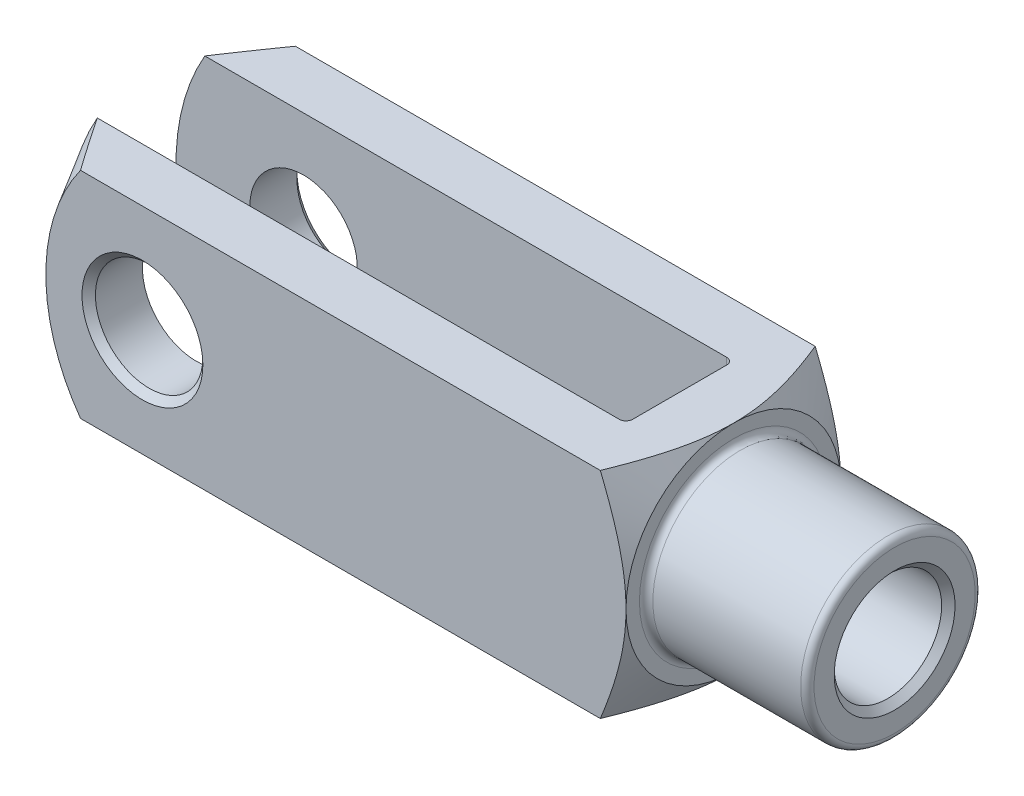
ISO-10303-21;
HEADER;
FILE_DESCRIPTION(('STEP AP214'),'2;1');
FILE_NAME('part.step','',(''),(''),'','','');
FILE_SCHEMA(('AUTOMOTIVE_DESIGN { 1 0 10303 214 1 1 1 1 }'));
ENDSEC;
DATA;
#1=APPLICATION_CONTEXT('core data for automotive mechanical design processes');
#2=APPLICATION_PROTOCOL_DEFINITION('international standard','automotive_design',2000,#1);
#3=PRODUCT_CONTEXT('',#1,'mechanical');
#4=PRODUCT('Part','Part','',(#3));
#5=PRODUCT_RELATED_PRODUCT_CATEGORY('part','',(#4));
#6=PRODUCT_DEFINITION_FORMATION('','',#4);
#7=PRODUCT_DEFINITION_CONTEXT('part definition',#1,'design');
#8=PRODUCT_DEFINITION('design','',#6,#7);
#9=PRODUCT_DEFINITION_SHAPE('','',#8);
#10=(LENGTH_UNIT() NAMED_UNIT(*) SI_UNIT(.MILLI.,.METRE.));
#11=(NAMED_UNIT(*) PLANE_ANGLE_UNIT() SI_UNIT($,.RADIAN.));
#12=(NAMED_UNIT(*) SI_UNIT($,.STERADIAN.) SOLID_ANGLE_UNIT());
#13=UNCERTAINTY_MEASURE_WITH_UNIT(LENGTH_MEASURE(1.E-05),#10,'distance_accuracy_value','');
#14=(GEOMETRIC_REPRESENTATION_CONTEXT(3) GLOBAL_UNCERTAINTY_ASSIGNED_CONTEXT((#13)) GLOBAL_UNIT_ASSIGNED_CONTEXT((#10,
#11,#12)) REPRESENTATION_CONTEXT('',''));
#15=CARTESIAN_POINT('',(0.,0.,0.));
#16=DIRECTION('',(0.,0.,1.));
#17=DIRECTION('',(1.,0.,0.));
#18=AXIS2_PLACEMENT_3D('',#15,#16,#17);
#19=CARTESIAN_POINT('',(-33.,-16.,-6.99999999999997));
#20=DIRECTION('',(0.,-1.,0.));
#21=DIRECTION('',(0.,0.,-1.));
#22=AXIS2_PLACEMENT_3D('',#19,#20,#21);
#23=CYLINDRICAL_SURFACE('',#22,1.);
#24=DIRECTION('',(0.,1.,0.));
#25=VECTOR('',#24,1.);
#26=CARTESIAN_POINT('',(-32.,-16.,-6.99999999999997));
#27=LINE('',#26,#25);
#28=CARTESIAN_POINT('',(-32.,-3.87298334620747,-6.99999999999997));
#29=VERTEX_POINT('',#28);
#30=CARTESIAN_POINT('',(-32.,-16.,-6.99999999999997));
#31=VERTEX_POINT('',#30);
#32=EDGE_CURVE('E359',#29,#31,#27,.F.);
#33=ORIENTED_EDGE('',*,*,#32,.F.);
#34=CARTESIAN_POINT('',(-32.,-3.87298334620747,-6.99999999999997));
#35=CARTESIAN_POINT('',(-32.0000090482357,-3.81506111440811,-7.03204875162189));
#36=CARTESIAN_POINT('',(-32.0015394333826,-3.75675902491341,-7.06336585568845));
#37=CARTESIAN_POINT('',(-32.00730166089,-3.63952511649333,-7.12448038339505));
#38=CARTESIAN_POINT('',(-32.0115323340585,-3.58059358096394,-7.15427845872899));
#39=CARTESIAN_POINT('',(-32.0277410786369,-3.40324230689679,-7.24121872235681));
#40=CARTESIAN_POINT('',(-32.0432390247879,-3.28400247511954,-7.29605254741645));
#41=CARTESIAN_POINT('',(-32.081478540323,-3.04456972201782,-7.39915667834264));
#42=CARTESIAN_POINT('',(-32.1041870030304,-2.92438355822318,-7.44745557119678));
#43=CARTESIAN_POINT('',(-32.1553570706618,-2.68282861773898,-7.53784294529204));
#44=CARTESIAN_POINT('',(-32.1838229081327,-2.56145903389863,-7.57992681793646));
#45=CARTESIAN_POINT('',(-32.2648278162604,-2.24038507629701,-7.68273685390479));
#46=CARTESIAN_POINT('',(-32.3211617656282,-2.03996193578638,-7.73829278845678));
#47=CARTESIAN_POINT('',(-32.441850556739,-1.63779800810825,-7.83328651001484));
#48=CARTESIAN_POINT('',(-32.5062087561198,-1.43605670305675,-7.87271752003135));
#49=CARTESIAN_POINT('',(-32.7067987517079,-0.829293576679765,-7.96742194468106));
#50=CARTESIAN_POINT('',(-32.8505643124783,-0.422667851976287,-7.99912712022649));
#51=CARTESIAN_POINT('',(-32.9960248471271,-0.0112434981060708,-7.99999406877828));
#52=CARTESIAN_POINT('',(-32.9980124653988,-0.00562166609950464,-7.99999999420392));
#53=CARTESIAN_POINT('',(-33.,0.,-7.99999999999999));
#54=B_SPLINE_CURVE_WITH_KNOTS('',3,(#34,#35,#36,#37,#38,#39,#40,#41,#42,#43,#44,#45,#46,#47,#48,
#49,#50,#51,#52,#53),.UNSPECIFIED.,.F.,.F.,(4,2,2,2,2,2,2,2,2,4),(0.,0.198535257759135,
0.396984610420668,0.792983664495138,1.18719018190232,1.58168756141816,2.22713013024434,
2.87284368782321,4.16406208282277,4.18195063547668),.UNSPECIFIED.);
#55=CARTESIAN_POINT('',(-33.,0.,-7.99999999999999));
#56=VERTEX_POINT('',#55);
#57=EDGE_CURVE('E392',#29,#56,#54,.T.);
#58=ORIENTED_EDGE('',*,*,#57,.T.);
#59=DIRECTION('',(0.,1.,0.));
#60=VECTOR('',#59,1.);
#61=CARTESIAN_POINT('',(-33.,16.,-7.99999999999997));
#62=LINE('',#61,#60);
#63=CARTESIAN_POINT('',(-33.,-16.,-7.99999999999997));
#64=VERTEX_POINT('',#63);
#65=EDGE_CURVE('E183',#64,#56,#62,.T.);
#66=ORIENTED_EDGE('',*,*,#65,.F.);
#67=CARTESIAN_POINT('',(-33.,-16.,-6.99999999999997));
#68=DIRECTION('',(0.,-1.,0.));
#69=DIRECTION('',(0.,0.,-1.));
#70=AXIS2_PLACEMENT_3D('',#67,#68,#69);
#71=CIRCLE('',#70,1.);
#72=EDGE_CURVE('E198',#31,#64,#71,.F.);
#73=ORIENTED_EDGE('',*,*,#72,.F.);
#74=EDGE_LOOP('',(#33,#58,#66,#73));
#75=FACE_BOUND('',#74,.T.);
#76=ADVANCED_FACE('F37',(#75),#23,.F.);
#77=CARTESIAN_POINT('',(-32.,-16.,-7.99999999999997));
#78=DIRECTION('',(1.,0.,0.));
#79=DIRECTION('',(0.,0.,-1.));
#80=AXIS2_PLACEMENT_3D('',#77,#78,#79);
#81=PLANE('',#80);
#82=CARTESIAN_POINT('',(-32.,16.,-6.99999999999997));
#83=VERTEX_POINT('',#82);
#84=CARTESIAN_POINT('',(-32.,3.87298334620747,-6.99999999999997));
#85=VERTEX_POINT('',#84);
#86=EDGE_CURVE('E375',#83,#85,#27,.F.);
#87=ORIENTED_EDGE('',*,*,#86,.T.);
#88=CARTESIAN_POINT('',(-32.,0.,0.));
#89=DIRECTION('',(1.,0.,0.));
#90=DIRECTION('',(0.,0.,-1.));
#91=AXIS2_PLACEMENT_3D('',#88,#89,#90);
#92=CIRCLE('',#91,8.);
#93=CARTESIAN_POINT('',(-32.,3.87298334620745,6.99999999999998));
#94=VERTEX_POINT('',#93);
#95=EDGE_CURVE('E745',#85,#94,#92,.T.);
#96=ORIENTED_EDGE('',*,*,#95,.T.);
#97=DIRECTION('',(0.,1.,0.));
#98=VECTOR('',#97,1.);
#99=CARTESIAN_POINT('',(-32.,16.,6.99999999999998));
#100=LINE('',#99,#98);
#101=CARTESIAN_POINT('',(-32.,16.,6.99999999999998));
#102=VERTEX_POINT('',#101);
#103=EDGE_CURVE('E160',#94,#102,#100,.T.);
#104=ORIENTED_EDGE('',*,*,#103,.T.);
#105=DIRECTION('',(0.,0.,-1.));
#106=VECTOR('',#105,1.);
#107=CARTESIAN_POINT('',(-32.,16.,-7.99999999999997));
#108=LINE('',#107,#106);
#109=EDGE_CURVE('E339',#102,#83,#108,.T.);
#110=ORIENTED_EDGE('',*,*,#109,.T.);
#111=EDGE_LOOP('',(#87,#96,#104,#110));
#112=FACE_BOUND('',#111,.T.);
#113=ADVANCED_FACE('F467',(#112),#81,.F.);
#114=CARTESIAN_POINT('',(-33.,-16.,6.99999999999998));
#115=DIRECTION('',(0.,-1.,0.));
#116=DIRECTION('',(0.,0.,-1.));
#117=AXIS2_PLACEMENT_3D('',#114,#115,#116);
#118=CYLINDRICAL_SURFACE('',#117,1.);
#119=ORIENTED_EDGE('',*,*,#103,.F.);
#120=CARTESIAN_POINT('',(-32.,3.87298334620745,6.99999999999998));
#121=CARTESIAN_POINT('',(-32.0000090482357,3.81506111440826,7.03204875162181));
#122=CARTESIAN_POINT('',(-32.0015394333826,3.75675902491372,7.06336585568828));
#123=CARTESIAN_POINT('',(-32.00730166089,3.63952511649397,7.12448038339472));
#124=CARTESIAN_POINT('',(-32.0115323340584,3.58059358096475,7.15427845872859));
#125=CARTESIAN_POINT('',(-32.0277410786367,3.40324230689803,7.24121872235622));
#126=CARTESIAN_POINT('',(-32.0432390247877,3.28400247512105,7.29605254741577));
#127=CARTESIAN_POINT('',(-32.0814785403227,3.04456972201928,7.39915667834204));
#128=CARTESIAN_POINT('',(-32.1041870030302,2.92438355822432,7.44745557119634));
#129=CARTESIAN_POINT('',(-32.1553570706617,2.68282861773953,7.53784294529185));
#130=CARTESIAN_POINT('',(-32.1838229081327,2.56145903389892,7.57992681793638));
#131=CARTESIAN_POINT('',(-32.2648278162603,2.24038507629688,7.68273685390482));
#132=CARTESIAN_POINT('',(-32.3211617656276,2.03996193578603,7.73829278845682));
#133=CARTESIAN_POINT('',(-32.4418505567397,1.63779800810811,7.83328651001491));
#134=CARTESIAN_POINT('',(-32.5062087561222,1.43605670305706,7.87271752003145));
#135=CARTESIAN_POINT('',(-32.7067987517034,0.829293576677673,7.96742194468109));
#136=CARTESIAN_POINT('',(-32.850564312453,0.422667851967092,7.99912712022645));
#137=CARTESIAN_POINT('',(-32.9960248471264,0.0112434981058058,7.99999406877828));
#138=CARTESIAN_POINT('',(-32.9980124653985,0.00562166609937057,7.99999999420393));
#139=CARTESIAN_POINT('',(-33.,0.,7.99999999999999));
#140=B_SPLINE_CURVE_WITH_KNOTS('',3,(#120,#121,#122,#123,#124,#125,#126,#127,#128,#129,#130,
#131,#132,#133,#134,#135,#136,#137,#138,#139),.UNSPECIFIED.,.F.,.F.,(4,2,2,2,2,2,2,2,2,4),(0.,
0.198535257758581,0.396984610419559,0.792983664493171,1.18719018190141,1.58168756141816,
2.22713013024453,2.8728436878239,4.1640620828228,4.18195063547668),.UNSPECIFIED.);
#141=CARTESIAN_POINT('',(-33.,0.,7.99999999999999));
#142=VERTEX_POINT('',#141);
#143=EDGE_CURVE('E145',#94,#142,#140,.T.);
#144=ORIENTED_EDGE('',*,*,#143,.T.);
#145=DIRECTION('',(0.,1.,0.));
#146=VECTOR('',#145,1.);
#147=CARTESIAN_POINT('',(-33.,-16.,7.99999999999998));
#148=LINE('',#147,#146);
#149=CARTESIAN_POINT('',(-33.,16.,7.99999999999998));
#150=VERTEX_POINT('',#149);
#151=EDGE_CURVE('E159',#150,#142,#148,.F.);
#152=ORIENTED_EDGE('',*,*,#151,.F.);
#153=CARTESIAN_POINT('',(-33.,16.,6.99999999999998));
#154=DIRECTION('',(0.,1.,0.));
#155=DIRECTION('',(0.,0.,1.));
#156=AXIS2_PLACEMENT_3D('',#153,#154,#155);
#157=CIRCLE('',#156,1.);
#158=EDGE_CURVE('E190',#102,#150,#157,.F.);
#159=ORIENTED_EDGE('',*,*,#158,.F.);
#160=EDGE_LOOP('',(#119,#144,#152,#159));
#161=FACE_BOUND('',#160,.T.);
#162=ADVANCED_FACE('F156',(#161),#118,.F.);
#163=CARTESIAN_POINT('',(-115.,-16.,-7.99999999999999));
#164=DIRECTION('',(0.,0.,-1.));
#165=DIRECTION('',(-1.,0.,0.));
#166=AXIS2_PLACEMENT_3D('',#163,#164,#165);
#167=PLANE('',#166);
#168=CARTESIAN_POINT('',(-96.,0.,-7.99999999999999));
#169=DIRECTION('',(0.,0.,-1.));
#170=DIRECTION('',(-1.,0.,0.));
#171=AXIS2_PLACEMENT_3D('',#168,#169,#170);
#172=CIRCLE('',#171,8.);
#173=CARTESIAN_POINT('',(-104.,0.,-7.99999999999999));
#174=VERTEX_POINT('',#173);
#175=EDGE_CURVE('E369',#174,#174,#172,.F.);
#176=ORIENTED_EDGE('',*,*,#175,.F.);
#177=EDGE_LOOP('',(#176));
#178=FACE_BOUND('',#177,.T.);
#179=CARTESIAN_POINT('',(-83.,0.,-7.99999999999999));
#180=DIRECTION('',(0.,0.,1.));
#181=DIRECTION('',(1.,0.,0.));
#182=AXIS2_PLACEMENT_3D('',#179,#180,#181);
#183=CIRCLE('',#182,32.);
#184=CARTESIAN_POINT('',(-110.712812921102,16.,-7.99999999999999));
#185=VERTEX_POINT('',#184);
#186=CARTESIAN_POINT('',(-110.712812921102,-16.,-7.99999999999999));
#187=VERTEX_POINT('',#186);
#188=EDGE_CURVE('E277',#185,#187,#183,.T.);
#189=ORIENTED_EDGE('',*,*,#188,.T.);
#190=DIRECTION('',(-1.,0.,0.));
#191=VECTOR('',#190,1.);
#192=CARTESIAN_POINT('',(-115.,-16.,-7.99999999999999));
#193=LINE('',#192,#191);
#194=EDGE_CURVE('E334',#64,#187,#193,.T.);
#195=ORIENTED_EDGE('',*,*,#194,.F.);
#196=ORIENTED_EDGE('',*,*,#65,.T.);
#197=CARTESIAN_POINT('',(-33.,16.,-7.99999999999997));
#198=VERTEX_POINT('',#197);
#199=EDGE_CURVE('E179',#56,#198,#62,.T.);
#200=ORIENTED_EDGE('',*,*,#199,.T.);
#201=DIRECTION('',(-1.,0.,0.));
#202=VECTOR('',#201,1.);
#203=CARTESIAN_POINT('',(-115.,16.,-7.99999999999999));
#204=LINE('',#203,#202);
#205=EDGE_CURVE('E347',#198,#185,#204,.T.);
#206=ORIENTED_EDGE('',*,*,#205,.T.);
#207=EDGE_LOOP('',(#189,#195,#196,#200,#206));
#208=FACE_BOUND('',#207,.T.);
#209=ADVANCED_FACE('F395',(#178,#208),#167,.F.);
#210=CARTESIAN_POINT('',(-115.,-16.,8.00000000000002));
#211=DIRECTION('',(0.,0.,1.));
#212=DIRECTION('',(1.,0.,0.));
#213=AXIS2_PLACEMENT_3D('',#210,#211,#212);
#214=PLANE('',#213);
#215=CARTESIAN_POINT('',(-96.,0.,8.00000000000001));
#216=DIRECTION('',(0.,0.,1.));
#217=DIRECTION('',(1.,0.,0.));
#218=AXIS2_PLACEMENT_3D('',#215,#216,#217);
#219=CIRCLE('',#218,8.);
#220=CARTESIAN_POINT('',(-88.,0.,8.00000000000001));
#221=VERTEX_POINT('',#220);
#222=EDGE_CURVE('E346',#221,#221,#219,.F.);
#223=ORIENTED_EDGE('',*,*,#222,.F.);
#224=EDGE_LOOP('',(#223));
#225=FACE_BOUND('',#224,.T.);
#226=DIRECTION('',(1.,0.,0.));
#227=VECTOR('',#226,1.);
#228=CARTESIAN_POINT('',(-115.,-16.,8.00000000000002));
#229=LINE('',#228,#227);
#230=CARTESIAN_POINT('',(-110.712812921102,-16.,8.00000000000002));
#231=VERTEX_POINT('',#230);
#232=CARTESIAN_POINT('',(-33.,-16.,7.99999999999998));
#233=VERTEX_POINT('',#232);
#234=EDGE_CURVE('E338',#231,#233,#229,.T.);
#235=ORIENTED_EDGE('',*,*,#234,.F.);
#236=CARTESIAN_POINT('',(-83.,0.,8.00000000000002));
#237=DIRECTION('',(0.,0.,1.));
#238=DIRECTION('',(1.,0.,0.));
#239=AXIS2_PLACEMENT_3D('',#236,#237,#238);
#240=CIRCLE('',#239,32.);
#241=CARTESIAN_POINT('',(-110.712812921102,16.,8.00000000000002));
#242=VERTEX_POINT('',#241);
#243=EDGE_CURVE('E423',#242,#231,#240,.T.);
#244=ORIENTED_EDGE('',*,*,#243,.F.);
#245=DIRECTION('',(1.,0.,0.));
#246=VECTOR('',#245,1.);
#247=CARTESIAN_POINT('',(-115.,16.,8.00000000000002));
#248=LINE('',#247,#246);
#249=EDGE_CURVE('E176',#242,#150,#248,.T.);
#250=ORIENTED_EDGE('',*,*,#249,.T.);
#251=ORIENTED_EDGE('',*,*,#151,.T.);
#252=EDGE_CURVE('E164',#142,#233,#148,.F.);
#253=ORIENTED_EDGE('',*,*,#252,.T.);
#254=EDGE_LOOP('',(#235,#244,#250,#251,#253));
#255=FACE_BOUND('',#254,.T.);
#256=ADVANCED_FACE('F173',(#225,#255),#214,.F.);
#257=CARTESIAN_POINT('',(-115.,-16.,16.));
#258=DIRECTION('',(0.,0.,1.));
#259=DIRECTION('',(1.,0.,0.));
#260=AXIS2_PLACEMENT_3D('',#257,#258,#259);
#261=PLANE('',#260);
#262=CARTESIAN_POINT('',(-96.,0.,16.));
#263=DIRECTION('',(0.,0.,1.));
#264=DIRECTION('',(1.,0.,0.));
#265=AXIS2_PLACEMENT_3D('',#262,#263,#264);
#266=CIRCLE('',#265,8.99999999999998);
#267=CARTESIAN_POINT('',(-87.,0.,16.));
#268=VERTEX_POINT('',#267);
#269=EDGE_CURVE('E229',#268,#268,#266,.F.);
#270=ORIENTED_EDGE('',*,*,#269,.T.);
#271=EDGE_LOOP('',(#270));
#272=FACE_BOUND('',#271,.T.);
#273=DIRECTION('',(1.,0.,0.));
#274=VECTOR('',#273,1.);
#275=CARTESIAN_POINT('',(-115.,16.,16.));
#276=LINE('',#275,#274);
#277=CARTESIAN_POINT('',(-105.220035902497,16.,16.));
#278=VERTEX_POINT('',#277);
#279=CARTESIAN_POINT('',(-27.8263409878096,16.,16.));
#280=VERTEX_POINT('',#279);
#281=EDGE_CURVE('E366',#278,#280,#276,.T.);
#282=ORIENTED_EDGE('',*,*,#281,.F.);
#283=CARTESIAN_POINT('',(-83.,0.,16.));
#284=DIRECTION('',(0.,0.,1.));
#285=DIRECTION('',(1.,0.,0.));
#286=AXIS2_PLACEMENT_3D('',#283,#284,#285);
#287=CIRCLE('',#286,27.381197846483);
#288=CARTESIAN_POINT('',(-105.220035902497,-16.,16.));
#289=VERTEX_POINT('',#288);
#290=EDGE_CURVE('E61',#278,#289,#287,.T.);
#291=ORIENTED_EDGE('',*,*,#290,.T.);
#292=DIRECTION('',(1.,0.,0.));
#293=VECTOR('',#292,1.);
#294=CARTESIAN_POINT('',(-115.,-16.,16.));
#295=LINE('',#294,#293);
#296=CARTESIAN_POINT('',(-27.8263409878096,-16.,16.));
#297=VERTEX_POINT('',#296);
#298=EDGE_CURVE('E363',#289,#297,#295,.T.);
#299=ORIENTED_EDGE('',*,*,#298,.T.);
#300=CARTESIAN_POINT('',(-35.7693975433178,-32.6784696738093,16.));
#301=CARTESIAN_POINT('',(-35.5649534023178,-32.2841914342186,16.));
#302=CARTESIAN_POINT('',(-35.3610695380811,-31.8896227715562,16.));
#303=CARTESIAN_POINT('',(-34.9545422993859,-31.0998453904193,16.));
#304=CARTESIAN_POINT('',(-34.7518989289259,-30.7046366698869,16.));
#305=CARTESIAN_POINT('',(-34.1459910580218,-29.5179255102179,16.));
#306=CARTESIAN_POINT('',(-33.7447694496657,-28.725377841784,16.));
#307=CARTESIAN_POINT('',(-32.948304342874,-27.1355535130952,16.));
#308=CARTESIAN_POINT('',(-32.5530724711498,-26.3382710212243,16.));
#309=CARTESIAN_POINT('',(-31.7709229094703,-24.7396478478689,16.));
#310=CARTESIAN_POINT('',(-31.3840050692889,-23.9383072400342,16.));
#311=CARTESIAN_POINT('',(-30.5971278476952,-22.2812030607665,16.));
#312=CARTESIAN_POINT('',(-30.1978306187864,-21.4251243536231,16.));
#313=CARTESIAN_POINT('',(-29.4144189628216,-19.7059517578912,16.));
#314=CARTESIAN_POINT('',(-29.0303053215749,-18.8428575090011,16.));
#315=CARTESIAN_POINT('',(-28.469277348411,-17.5419055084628,16.));
#316=CARTESIAN_POINT('',(-28.2848287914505,-17.1072946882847,16.));
#317=CARTESIAN_POINT('',(-27.9217435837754,-16.2356552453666,16.));
#318=CARTESIAN_POINT('',(-27.7431068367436,-15.7986266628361,16.));
#319=CARTESIAN_POINT('',(-27.3925648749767,-14.9219132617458,16.));
#320=CARTESIAN_POINT('',(-27.2206591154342,-14.4822286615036,16.));
#321=CARTESIAN_POINT('',(-26.8846508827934,-13.5998952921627,16.));
#322=CARTESIAN_POINT('',(-26.7205482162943,-13.15724659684,16.));
#323=CARTESIAN_POINT('',(-26.3667959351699,-12.1723292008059,16.));
#324=CARTESIAN_POINT('',(-26.1793236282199,-11.6292738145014,16.));
#325=CARTESIAN_POINT('',(-25.8205117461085,-10.5378822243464,16.));
#326=CARTESIAN_POINT('',(-25.6491707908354,-9.98954647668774,16.));
#327=CARTESIAN_POINT('',(-25.3258019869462,-8.88718113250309,16.));
#328=CARTESIAN_POINT('',(-25.1737737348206,-8.33315165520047,16.));
#329=CARTESIAN_POINT('',(-24.892661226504,-7.21925530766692,16.));
#330=CARTESIAN_POINT('',(-24.763576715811,-6.65938850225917,16.));
#331=CARTESIAN_POINT('',(-24.5349588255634,-5.54729135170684,16.));
#332=CARTESIAN_POINT('',(-24.4348028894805,-4.99519025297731,16.));
#333=CARTESIAN_POINT('',(-24.2636126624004,-3.88645323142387,16.));
#334=CARTESIAN_POINT('',(-24.1925774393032,-3.32981745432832,16.));
#335=CARTESIAN_POINT('',(-24.0825979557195,-2.21371046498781,16.));
#336=CARTESIAN_POINT('',(-24.0436327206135,-1.65424134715,16.));
#337=CARTESIAN_POINT('',(-23.9995121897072,-0.533966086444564,16.));
#338=CARTESIAN_POINT('',(-23.9943557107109,0.0268400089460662,16.));
#339=CARTESIAN_POINT('',(-24.0172205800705,1.10686412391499,16.));
#340=CARTESIAN_POINT('',(-24.0428517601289,1.62613491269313,16.));
#341=CARTESIAN_POINT('',(-24.1223285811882,2.66248971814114,16.));
#342=CARTESIAN_POINT('',(-24.1761741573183,3.17957373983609,16.));
#343=CARTESIAN_POINT('',(-24.3101058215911,4.21056490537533,16.));
#344=CARTESIAN_POINT('',(-24.3902054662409,4.72447026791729,16.));
#345=CARTESIAN_POINT('',(-24.5740043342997,5.74801582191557,16.));
#346=CARTESIAN_POINT('',(-24.6777042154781,6.25765589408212,16.));
#347=CARTESIAN_POINT('',(-24.909120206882,7.2869259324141,16.));
#348=CARTESIAN_POINT('',(-25.0374445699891,7.80641809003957,16.));
#349=CARTESIAN_POINT('',(-25.3129308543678,8.84034891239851,16.));
#350=CARTESIAN_POINT('',(-25.4600929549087,9.3547875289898,16.));
#351=CARTESIAN_POINT('',(-25.7704071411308,10.3787720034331,16.));
#352=CARTESIAN_POINT('',(-25.9335585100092,10.8883180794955,16.));
#353=CARTESIAN_POINT('',(-26.1884088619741,11.6492037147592,16.));
#354=CARTESIAN_POINT('',(-26.2750447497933,11.9022560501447,16.));
#355=CARTESIAN_POINT('',(-26.4514227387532,12.4072754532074,16.));
#356=CARTESIAN_POINT('',(-26.5411648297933,12.6592425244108,16.));
#357=CARTESIAN_POINT('',(-26.8295171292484,13.454575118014,16.));
#358=CARTESIAN_POINT('',(-27.0333628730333,13.9960468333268,16.));
#359=CARTESIAN_POINT('',(-27.4521222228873,15.0747063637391,16.));
#360=CARTESIAN_POINT('',(-27.6670364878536,15.6118939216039,16.));
#361=CARTESIAN_POINT('',(-28.1061456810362,16.6825956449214,16.));
#362=CARTESIAN_POINT('',(-28.3303426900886,17.216108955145,16.));
#363=CARTESIAN_POINT('',(-28.786473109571,18.2797983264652,16.));
#364=CARTESIAN_POINT('',(-29.0184063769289,18.8099744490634,16.));
#365=CARTESIAN_POINT('',(-29.4890009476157,19.8678755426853,16.));
#366=CARTESIAN_POINT('',(-29.727667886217,20.3955980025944,16.));
#367=CARTESIAN_POINT('',(-30.2105443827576,21.448499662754,16.));
#368=CARTESIAN_POINT('',(-30.4547539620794,21.9736788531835,16.));
#369=CARTESIAN_POINT('',(-30.9478700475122,23.0217502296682,16.));
#370=CARTESIAN_POINT('',(-31.1967760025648,23.5446426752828,16.));
#371=CARTESIAN_POINT('',(-31.6986473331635,24.5884772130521,16.));
#372=CARTESIAN_POINT('',(-31.951612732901,25.1094192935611,16.));
#373=CARTESIAN_POINT('',(-32.7172875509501,26.6728451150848,16.));
#374=CARTESIAN_POINT('',(-33.2352702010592,27.7127471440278,16.));
#375=CARTESIAN_POINT('',(-34.2818275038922,29.7872182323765,16.));
#376=CARTESIAN_POINT('',(-34.8104023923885,30.8217871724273,16.));
#377=CARTESIAN_POINT('',(-35.8754784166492,32.8861860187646,16.));
#378=CARTESIAN_POINT('',(-36.4119755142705,33.916018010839,16.));
#379=CARTESIAN_POINT('',(-37.491399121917,35.9722925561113,16.));
#380=CARTESIAN_POINT('',(-38.0343255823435,36.9987351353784,16.));
#381=CARTESIAN_POINT('',(-39.0443143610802,38.8966473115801,16.));
#382=CARTESIAN_POINT('',(-39.5106690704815,39.768493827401,16.));
#383=CARTESIAN_POINT('',(-40.446506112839,41.5105071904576,16.));
#384=CARTESIAN_POINT('',(-40.9159884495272,42.3806740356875,16.));
#385=CARTESIAN_POINT('',(-42.3285002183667,44.9892873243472,16.));
#386=CARTESIAN_POINT('',(-43.2754644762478,46.7256030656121,16.));
#387=CARTESIAN_POINT('',(-45.1715733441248,50.1841146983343,16.));
#388=CARTESIAN_POINT('',(-46.120674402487,51.9063345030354,16.));
#389=CARTESIAN_POINT('',(-47.5485244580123,54.4871624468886,16.));
#390=CARTESIAN_POINT('',(-48.0251365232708,55.346953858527,16.));
#391=CARTESIAN_POINT('',(-48.9796167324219,57.0658379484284,16.));
#392=CARTESIAN_POINT('',(-49.4574848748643,57.9249306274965,16.));
#393=CARTESIAN_POINT('',(-49.9358976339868,58.7837198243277,16.));
#394=B_SPLINE_CURVE_WITH_KNOTS('',3,(#300,#301,#302,#303,#304,#305,#306,#307,#308,#309,#310,
#311,#312,#313,#314,#315,#316,#317,#318,#319,#320,#321,#322,#323,#324,#325,#326,#327,#328,#329,
#330,#331,#332,#333,#334,#335,#336,#337,#338,#339,#340,#341,#342,#343,#344,#345,#346,#347,#348,
#349,#350,#351,#352,#353,#354,#355,#356,#357,#358,#359,#360,#361,#362,#363,#364,#365,#366,#367,
#368,#369,#370,#371,#372,#373,#374,#375,#376,#377,#378,#379,#380,#381,#382,#383,#384,#385,#386,
#387,#388,#389,#390,#391,#392,#393),.UNSPECIFIED.,.F.,.F.,(4,2,2,2,2,2,2,2,2,2,2,2,2,2,2,2,2,2,
2,2,2,2,2,2,2,2,2,2,2,2,2,2,2,2,2,2,2,2,2,2,2,2,2,2,2,2,4),(0.,1.33239347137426,
2.66479123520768,5.32972119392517,7.99929176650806,10.6688140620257,13.5025727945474,
16.3364779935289,17.7528378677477,19.1691742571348,20.5853957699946,22.0015821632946,
23.7248813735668,25.4480330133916,27.1711486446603,28.8942451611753,30.5768935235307,
32.2594880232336,33.9409811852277,35.6224155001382,37.1813298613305,38.7402406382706,
40.2999576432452,41.8597181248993,43.4646245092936,45.0695461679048,46.6743959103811,
47.4767954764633,48.2791924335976,50.0147426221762,51.7503962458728,53.4864410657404,
55.2224537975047,56.95996517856,58.6974832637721,60.4347987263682,62.1721245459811,
65.6573336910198,69.1426204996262,72.626188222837,76.1097290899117,79.0759362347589,
82.0421469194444,87.9753961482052,93.8746630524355,96.8238320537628,99.772997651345),.UNSPECIFIED.);
#395=CARTESIAN_POINT('',(-24.,0.,16.));
#396=VERTEX_POINT('',#395);
#397=EDGE_CURVE('E306',#396,#297,#394,.F.);
#398=ORIENTED_EDGE('',*,*,#397,.F.);
#399=EDGE_CURVE('E304',#280,#396,#394,.F.);
#400=ORIENTED_EDGE('',*,*,#399,.F.);
#401=EDGE_LOOP('',(#282,#291,#299,#398,#400));
#402=FACE_BOUND('',#401,.T.);
#403=ADVANCED_FACE('F288',(#272,#402),#261,.T.);
#404=CARTESIAN_POINT('',(-115.,-16.,16.));
#405=DIRECTION('',(0.,-1.,0.));
#406=DIRECTION('',(0.,0.,-1.));
#407=AXIS2_PLACEMENT_3D('',#404,#405,#406);
#408=PLANE('',#407);
#409=ORIENTED_EDGE('',*,*,#194,.T.);
#410=CARTESIAN_POINT('',(-123.371429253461,-16.,11.7911070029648));
#411=CARTESIAN_POINT('',(-122.592945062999,-16.,10.5376757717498));
#412=CARTESIAN_POINT('',(-121.81232808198,-16.,9.28556385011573));
#413=CARTESIAN_POINT('',(-120.245832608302,-16.,6.78460141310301));
#414=CARTESIAN_POINT('',(-119.459954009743,-16.,5.53575096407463));
#415=CARTESIAN_POINT('',(-117.881028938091,-16.,3.04049656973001));
#416=CARTESIAN_POINT('',(-117.087975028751,-16.,1.79409732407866));
#417=CARTESIAN_POINT('',(-115.892706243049,-16.,-0.0718476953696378));
#418=CARTESIAN_POINT('',(-115.493337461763,-16.,-0.693217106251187));
#419=CARTESIAN_POINT('',(-114.692490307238,-16.,-1.9346009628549));
#420=CARTESIAN_POINT('',(-114.291011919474,-16.,-2.55461539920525));
#421=CARTESIAN_POINT('',(-113.049557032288,-16.,-4.46394316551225));
#422=CARTESIAN_POINT('',(-112.205685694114,-16.,-5.75072871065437));
#423=CARTESIAN_POINT('',(-110.505216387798,-16.,-8.31586424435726));
#424=CARTESIAN_POINT('',(-109.64861856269,-16.,-9.59421432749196));
#425=CARTESIAN_POINT('',(-108.351696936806,-16.,-11.5028868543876));
#426=CARTESIAN_POINT('',(-107.917546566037,-16.,-12.1374051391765));
#427=CARTESIAN_POINT('',(-107.04451814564,-16.,-13.4031790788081));
#428=CARTESIAN_POINT('',(-106.605640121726,-16.,-14.0344347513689));
#429=CARTESIAN_POINT('',(-105.722450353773,-16.,-15.2930972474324));
#430=CARTESIAN_POINT('',(-105.278138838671,-16.,-15.9205042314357));
#431=CARTESIAN_POINT('',(-104.383178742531,-16.,-17.170777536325));
#432=CARTESIAN_POINT('',(-103.932530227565,-16.,-17.7936439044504));
#433=CARTESIAN_POINT('',(-103.028029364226,-16.,-19.0281553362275));
#434=CARTESIAN_POINT('',(-102.574246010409,-16.,-19.63985087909));
#435=CARTESIAN_POINT('',(-101.658039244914,-16.,-20.8567662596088));
#436=CARTESIAN_POINT('',(-101.195615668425,-16.,-21.4619859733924));
#437=CARTESIAN_POINT('',(-100.259814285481,-16.,-22.6652514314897));
#438=CARTESIAN_POINT('',(-99.7864223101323,-16.,-23.2632861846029));
#439=CARTESIAN_POINT('',(-98.8271654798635,-16.,-24.4492371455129));
#440=CARTESIAN_POINT('',(-98.3413013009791,-16.,-25.0371538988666));
#441=CARTESIAN_POINT('',(-97.359384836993,-16.,-26.1940459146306));
#442=CARTESIAN_POINT('',(-96.8634904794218,-16.,-26.7631543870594));
#443=CARTESIAN_POINT('',(-96.1056619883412,-16.,-27.6043633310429));
#444=CARTESIAN_POINT('',(-95.8506801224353,-16.,-27.8827334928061));
#445=CARTESIAN_POINT('',(-95.3355101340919,-16.,-28.434607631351));
#446=CARTESIAN_POINT('',(-95.0753221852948,-16.,-28.7081117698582));
#447=CARTESIAN_POINT('',(-94.5496746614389,-16.,-29.2488627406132));
#448=CARTESIAN_POINT('',(-94.2842277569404,-16.,-29.5161218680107));
#449=CARTESIAN_POINT('',(-93.7468052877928,-16.,-30.0439769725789));
#450=CARTESIAN_POINT('',(-93.4748301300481,-16.,-30.3045733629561));
#451=CARTESIAN_POINT('',(-92.9236476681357,-16.,-30.8177372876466));
#452=CARTESIAN_POINT('',(-92.6444440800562,-16.,-31.0703088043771));
#453=CARTESIAN_POINT('',(-92.0777664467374,-16.,-31.5659640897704));
#454=CARTESIAN_POINT('',(-91.7902936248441,-16.,-31.8090492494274));
#455=CARTESIAN_POINT('',(-91.3468920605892,-16.,-32.1692925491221));
#456=CARTESIAN_POINT('',(-91.19437175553,-16.,-32.2906537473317));
#457=CARTESIAN_POINT('',(-90.8866765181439,-16.,-32.5299575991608));
#458=CARTESIAN_POINT('',(-90.731501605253,-16.,-32.6479002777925));
#459=CARTESIAN_POINT('',(-90.261690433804,-16.,-32.9961048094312));
#460=CARTESIAN_POINT('',(-89.9428096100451,-16.,-33.2207088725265));
#461=CARTESIAN_POINT('',(-89.2928256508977,-16.,-33.6509952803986));
#462=CARTESIAN_POINT('',(-88.9617323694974,-16.,-33.8566924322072));
#463=CARTESIAN_POINT('',(-88.2860892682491,-16.,-34.2447467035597));
#464=CARTESIAN_POINT('',(-87.9415429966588,-16.,-34.427109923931));
#465=CARTESIAN_POINT('',(-87.318754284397,-16.,-34.7245627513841));
#466=CARTESIAN_POINT('',(-87.0433165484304,-16.,-34.845508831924));
#467=CARTESIAN_POINT('',(-86.4844448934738,-16.,-35.0671656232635));
#468=CARTESIAN_POINT('',(-86.2010136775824,-16.,-35.167883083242));
#469=CARTESIAN_POINT('',(-85.6272287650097,-16.,-35.3459456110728));
#470=CARTESIAN_POINT('',(-85.3368843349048,-16.,-35.4233202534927));
#471=CARTESIAN_POINT('',(-84.7504269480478,-16.,-35.5520122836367));
#472=CARTESIAN_POINT('',(-84.4543142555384,-16.,-35.6033308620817));
#473=CARTESIAN_POINT('',(-83.8555360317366,-16.,-35.6780890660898));
#474=CARTESIAN_POINT('',(-83.5528345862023,-16.,-35.7012449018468));
#475=CARTESIAN_POINT('',(-82.9466256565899,-16.,-35.7176301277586));
#476=CARTESIAN_POINT('',(-82.643118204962,-16.,-35.7108607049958));
#477=CARTESIAN_POINT('',(-82.03817775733,-16.,-35.6677225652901));
#478=CARTESIAN_POINT('',(-81.7367451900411,-16.,-35.6313479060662));
#479=CARTESIAN_POINT('',(-81.1385996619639,-16.,-35.5306731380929));
#480=CARTESIAN_POINT('',(-80.8418874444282,-16.,-35.4663686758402));
#481=CARTESIAN_POINT('',(-80.2008177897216,-16.,-35.2982030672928));
#482=CARTESIAN_POINT('',(-79.857810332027,-16.,-35.1892223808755));
#483=CARTESIAN_POINT('',(-79.1829198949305,-16.,-34.940831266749));
#484=CARTESIAN_POINT('',(-78.8510432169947,-16.,-34.8014039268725));
#485=CARTESIAN_POINT('',(-78.3616955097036,-16.,-34.5731174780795));
#486=CARTESIAN_POINT('',(-78.1997313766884,-16.,-34.4936845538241));
#487=CARTESIAN_POINT('',(-77.8788299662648,-16.,-34.3290841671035));
#488=CARTESIAN_POINT('',(-77.7198913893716,-16.,-34.2439192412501));
#489=CARTESIAN_POINT('',(-77.2474402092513,-16.,-33.980610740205));
#490=CARTESIAN_POINT('',(-76.9382745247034,-16.,-33.7946450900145));
#491=CARTESIAN_POINT('',(-76.2312746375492,-16.,-33.3419896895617));
#492=CARTESIAN_POINT('',(-75.8376126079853,-16.,-33.0688272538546));
#493=CARTESIAN_POINT('',(-75.0671777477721,-16.,-32.4995062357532));
#494=CARTESIAN_POINT('',(-74.6904130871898,-16.,-32.2033367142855));
#495=CARTESIAN_POINT('',(-73.9509392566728,-16.,-31.5926380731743));
#496=CARTESIAN_POINT('',(-73.588258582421,-16.,-31.2780746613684));
#497=CARTESIAN_POINT('',(-72.8756929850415,-16.,-30.6349635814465));
#498=CARTESIAN_POINT('',(-72.5258059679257,-16.,-30.3064182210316));
#499=CARTESIAN_POINT('',(-71.8346538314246,-16.,-29.6358722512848));
#500=CARTESIAN_POINT('',(-71.4934620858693,-16.,-29.2937963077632));
#501=CARTESIAN_POINT('',(-70.8205894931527,-16.,-28.6004219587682));
#502=CARTESIAN_POINT('',(-70.4889089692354,-16.,-28.2491232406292));
#503=CARTESIAN_POINT('',(-69.8341115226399,-16.,-27.5393264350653));
#504=CARTESIAN_POINT('',(-69.5109860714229,-16.,-27.1808361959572));
#505=CARTESIAN_POINT('',(-68.8718712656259,-16.,-26.4575770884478));
#506=CARTESIAN_POINT('',(-68.5558817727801,-16.,-26.0928083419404));
#507=CARTESIAN_POINT('',(-67.8004695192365,-16.,-25.2057450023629));
#508=CARTESIAN_POINT('',(-67.364153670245,-16.,-24.6808057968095));
#509=CARTESIAN_POINT('',(-66.5017899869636,-16.,-23.6224177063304));
#510=CARTESIAN_POINT('',(-66.0757441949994,-16.,-23.0889671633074));
#511=CARTESIAN_POINT('',(-65.2388292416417,-16.,-22.0234541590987));
#512=CARTESIAN_POINT('',(-64.8278275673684,-16.,-21.4914956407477));
#513=CARTESIAN_POINT('',(-64.2167920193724,-16.,-20.6895302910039));
#514=CARTESIAN_POINT('',(-64.0140541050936,-16.,-20.4215769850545));
#515=CARTESIAN_POINT('',(-63.6102515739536,-16.,-19.8844163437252));
#516=CARTESIAN_POINT('',(-63.4091869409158,-16.,-19.6152090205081));
#517=CARTESIAN_POINT('',(-63.2088929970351,-16.,-19.3454290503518));
#518=B_SPLINE_CURVE_WITH_KNOTS('',3,(#410,#411,#412,#413,#414,#415,#416,#417,#418,#419,#420,
#421,#422,#423,#424,#425,#426,#427,#428,#429,#430,#431,#432,#433,#434,#435,#436,#437,#438,#439,
#440,#441,#442,#443,#444,#445,#446,#447,#448,#449,#450,#451,#452,#453,#454,#455,#456,#457,#458,
#459,#460,#461,#462,#463,#464,#465,#466,#467,#468,#469,#470,#471,#472,#473,#474,#475,#476,#477,
#478,#479,#480,#481,#482,#483,#484,#485,#486,#487,#488,#489,#490,#491,#492,#493,#494,#495,#496,
#497,#498,#499,#500,#501,#502,#503,#504,#505,#506,#507,#508,#509,#510,#511,#512,#513,#514,#515,
#516,#517),.UNSPECIFIED.,.F.,.F.,(4,2,2,2,2,2,2,2,2,2,2,2,2,2,2,2,2,2,2,2,2,2,2,2,2,2,2,2,2,2,2,
2,2,2,2,2,2,2,2,2,2,2,2,2,2,2,2,2,2,2,2,2,2,4),(0.,4.42653200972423,8.85315338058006,
13.2850586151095,15.5009877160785,17.7169320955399,22.33330454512,26.9496251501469,
29.2560988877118,31.5625600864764,33.8689244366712,36.1752647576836,38.4601118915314,
40.7450026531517,43.0330306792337,45.3209349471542,47.5851104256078,48.7175544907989,
49.8499608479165,50.9799088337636,52.1097865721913,53.2390945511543,54.3682363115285,
54.9529313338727,55.5376220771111,56.7071657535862,57.8757855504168,59.0440991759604,
59.9458947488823,60.8473889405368,61.7477361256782,62.6480421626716,63.5573471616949,
64.4666160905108,65.3760675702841,66.2856608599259,67.3636659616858,68.4422713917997,
68.983357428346,69.5242055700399,70.6058434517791,72.0422032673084,73.4792502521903,
74.9190675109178,76.3586480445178,77.8078630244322,79.2571271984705,80.704887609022,
82.1526199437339,84.2002258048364,86.2482355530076,88.2648689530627,89.2728889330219,
90.2808991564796),.UNSPECIFIED.);
#519=CARTESIAN_POINT('',(-105.220035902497,-16.,-16.));
#520=VERTEX_POINT('',#519);
#521=EDGE_CURVE('E276',#187,#520,#518,.T.);
#522=ORIENTED_EDGE('',*,*,#521,.T.);
#523=DIRECTION('',(1.,0.,0.));
#524=VECTOR('',#523,1.);
#525=CARTESIAN_POINT('',(-115.,-16.,-16.));
#526=LINE('',#525,#524);
#527=CARTESIAN_POINT('',(-27.8263409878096,-16.,-16.));
#528=VERTEX_POINT('',#527);
#529=EDGE_CURVE('E360',#520,#528,#526,.T.);
#530=ORIENTED_EDGE('',*,*,#529,.T.);
#531=CARTESIAN_POINT('',(-35.7693975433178,-16.,-32.6784696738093));
#532=CARTESIAN_POINT('',(-35.5649534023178,-16.,-32.2841914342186));
#533=CARTESIAN_POINT('',(-35.3610695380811,-16.,-31.8896227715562));
#534=CARTESIAN_POINT('',(-34.9545422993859,-16.,-31.0998453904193));
#535=CARTESIAN_POINT('',(-34.7518989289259,-16.,-30.7046366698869));
#536=CARTESIAN_POINT('',(-34.1459910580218,-16.,-29.5179255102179));
#537=CARTESIAN_POINT('',(-33.7447694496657,-16.,-28.725377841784));
#538=CARTESIAN_POINT('',(-32.948304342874,-16.,-27.1355535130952));
#539=CARTESIAN_POINT('',(-32.5530724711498,-16.,-26.3382710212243));
#540=CARTESIAN_POINT('',(-31.7709229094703,-16.,-24.7396478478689));
#541=CARTESIAN_POINT('',(-31.3840050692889,-16.,-23.9383072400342));
#542=CARTESIAN_POINT('',(-30.5971278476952,-16.,-22.2812030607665));
#543=CARTESIAN_POINT('',(-30.1978306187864,-16.,-21.4251243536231));
#544=CARTESIAN_POINT('',(-29.4144189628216,-16.,-19.7059517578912));
#545=CARTESIAN_POINT('',(-29.0303053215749,-16.,-18.8428575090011));
#546=CARTESIAN_POINT('',(-28.469277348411,-16.,-17.5419055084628));
#547=CARTESIAN_POINT('',(-28.2848287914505,-16.,-17.1072946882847));
#548=CARTESIAN_POINT('',(-27.9217435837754,-16.,-16.2356552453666));
#549=CARTESIAN_POINT('',(-27.7431068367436,-16.,-15.7986266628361));
#550=CARTESIAN_POINT('',(-27.3925648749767,-16.,-14.9219132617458));
#551=CARTESIAN_POINT('',(-27.2206591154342,-16.,-14.4822286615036));
#552=CARTESIAN_POINT('',(-26.8846508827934,-16.,-13.5998952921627));
#553=CARTESIAN_POINT('',(-26.7205482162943,-16.,-13.15724659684));
#554=CARTESIAN_POINT('',(-26.3667959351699,-16.,-12.1723292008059));
#555=CARTESIAN_POINT('',(-26.1793236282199,-16.,-11.6292738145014));
#556=CARTESIAN_POINT('',(-25.8205117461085,-16.,-10.5378822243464));
#557=CARTESIAN_POINT('',(-25.6491707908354,-16.,-9.98954647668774));
#558=CARTESIAN_POINT('',(-25.3258019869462,-16.,-8.88718113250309));
#559=CARTESIAN_POINT('',(-25.1737737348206,-16.,-8.33315165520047));
#560=CARTESIAN_POINT('',(-24.892661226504,-16.,-7.21925530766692));
#561=CARTESIAN_POINT('',(-24.763576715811,-16.,-6.65938850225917));
#562=CARTESIAN_POINT('',(-24.5349588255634,-16.,-5.54729135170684));
#563=CARTESIAN_POINT('',(-24.4348028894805,-16.,-4.99519025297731));
#564=CARTESIAN_POINT('',(-24.2636126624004,-16.,-3.88645323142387));
#565=CARTESIAN_POINT('',(-24.1925774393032,-16.,-3.32981745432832));
#566=CARTESIAN_POINT('',(-24.0825979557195,-16.,-2.21371046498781));
#567=CARTESIAN_POINT('',(-24.0436327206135,-16.,-1.65424134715));
#568=CARTESIAN_POINT('',(-23.9995121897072,-16.,-0.533966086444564));
#569=CARTESIAN_POINT('',(-23.9943557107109,-16.,0.0268400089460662));
#570=CARTESIAN_POINT('',(-24.0172205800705,-16.,1.10686412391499));
#571=CARTESIAN_POINT('',(-24.0428517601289,-16.,1.62613491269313));
#572=CARTESIAN_POINT('',(-24.1223285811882,-16.,2.66248971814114));
#573=CARTESIAN_POINT('',(-24.1761741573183,-16.,3.17957373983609));
#574=CARTESIAN_POINT('',(-24.3101058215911,-16.,4.21056490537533));
#575=CARTESIAN_POINT('',(-24.3902054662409,-16.,4.72447026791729));
#576=CARTESIAN_POINT('',(-24.5740043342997,-16.,5.74801582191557));
#577=CARTESIAN_POINT('',(-24.6777042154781,-16.,6.25765589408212));
#578=CARTESIAN_POINT('',(-24.909120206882,-16.,7.2869259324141));
#579=CARTESIAN_POINT('',(-25.0374445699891,-16.,7.80641809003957));
#580=CARTESIAN_POINT('',(-25.3129308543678,-16.,8.84034891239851));
#581=CARTESIAN_POINT('',(-25.4600929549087,-16.,9.3547875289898));
#582=CARTESIAN_POINT('',(-25.7704071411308,-16.,10.3787720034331));
#583=CARTESIAN_POINT('',(-25.9335585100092,-16.,10.8883180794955));
#584=CARTESIAN_POINT('',(-26.1884088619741,-16.,11.6492037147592));
#585=CARTESIAN_POINT('',(-26.2750447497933,-16.,11.9022560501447));
#586=CARTESIAN_POINT('',(-26.4514227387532,-16.,12.4072754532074));
#587=CARTESIAN_POINT('',(-26.5411648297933,-16.,12.6592425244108));
#588=CARTESIAN_POINT('',(-26.8295171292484,-16.,13.454575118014));
#589=CARTESIAN_POINT('',(-27.0333628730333,-16.,13.9960468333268));
#590=CARTESIAN_POINT('',(-27.4521222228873,-16.,15.0747063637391));
#591=CARTESIAN_POINT('',(-27.6670364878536,-16.,15.6118939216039));
#592=CARTESIAN_POINT('',(-28.1061456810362,-16.,16.6825956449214));
#593=CARTESIAN_POINT('',(-28.3303426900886,-16.,17.216108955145));
#594=CARTESIAN_POINT('',(-28.786473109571,-16.,18.2797983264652));
#595=CARTESIAN_POINT('',(-29.0184063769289,-16.,18.8099744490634));
#596=CARTESIAN_POINT('',(-29.4890009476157,-16.,19.8678755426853));
#597=CARTESIAN_POINT('',(-29.727667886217,-16.,20.3955980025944));
#598=CARTESIAN_POINT('',(-30.2105443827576,-16.,21.448499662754));
#599=CARTESIAN_POINT('',(-30.4547539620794,-16.,21.9736788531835));
#600=CARTESIAN_POINT('',(-30.9478700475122,-16.,23.0217502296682));
#601=CARTESIAN_POINT('',(-31.1967760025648,-16.,23.5446426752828));
#602=CARTESIAN_POINT('',(-31.6986473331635,-16.,24.5884772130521));
#603=CARTESIAN_POINT('',(-31.951612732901,-16.,25.1094192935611));
#604=CARTESIAN_POINT('',(-32.7172875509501,-16.,26.6728451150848));
#605=CARTESIAN_POINT('',(-33.2352702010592,-16.,27.7127471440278));
#606=CARTESIAN_POINT('',(-34.2818275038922,-16.,29.7872182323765));
#607=CARTESIAN_POINT('',(-34.8104023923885,-16.,30.8217871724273));
#608=CARTESIAN_POINT('',(-35.8754784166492,-16.,32.8861860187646));
#609=CARTESIAN_POINT('',(-36.4119755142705,-16.,33.916018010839));
#610=CARTESIAN_POINT('',(-37.491399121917,-16.,35.9722925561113));
#611=CARTESIAN_POINT('',(-38.0343255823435,-16.,36.9987351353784));
#612=CARTESIAN_POINT('',(-39.0443143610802,-16.,38.8966473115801));
#613=CARTESIAN_POINT('',(-39.5106690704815,-16.,39.768493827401));
#614=CARTESIAN_POINT('',(-40.446506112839,-16.,41.5105071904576));
#615=CARTESIAN_POINT('',(-40.9159884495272,-16.,42.3806740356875));
#616=CARTESIAN_POINT('',(-42.3285002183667,-16.,44.9892873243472));
#617=CARTESIAN_POINT('',(-43.2754644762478,-16.,46.7256030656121));
#618=CARTESIAN_POINT('',(-45.1715733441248,-16.,50.1841146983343));
#619=CARTESIAN_POINT('',(-46.120674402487,-16.,51.9063345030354));
#620=CARTESIAN_POINT('',(-47.5485244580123,-16.,54.4871624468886));
#621=CARTESIAN_POINT('',(-48.0251365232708,-16.,55.346953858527));
#622=CARTESIAN_POINT('',(-48.9796167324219,-16.,57.0658379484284));
#623=CARTESIAN_POINT('',(-49.4574848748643,-16.,57.9249306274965));
#624=CARTESIAN_POINT('',(-49.9358976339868,-16.,58.7837198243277));
#625=B_SPLINE_CURVE_WITH_KNOTS('',3,(#531,#532,#533,#534,#535,#536,#537,#538,#539,#540,#541,
#542,#543,#544,#545,#546,#547,#548,#549,#550,#551,#552,#553,#554,#555,#556,#557,#558,#559,#560,
#561,#562,#563,#564,#565,#566,#567,#568,#569,#570,#571,#572,#573,#574,#575,#576,#577,#578,#579,
#580,#581,#582,#583,#584,#585,#586,#587,#588,#589,#590,#591,#592,#593,#594,#595,#596,#597,#598,
#599,#600,#601,#602,#603,#604,#605,#606,#607,#608,#609,#610,#611,#612,#613,#614,#615,#616,#617,
#618,#619,#620,#621,#622,#623,#624),.UNSPECIFIED.,.F.,.F.,(4,2,2,2,2,2,2,2,2,2,2,2,2,2,2,2,2,2,
2,2,2,2,2,2,2,2,2,2,2,2,2,2,2,2,2,2,2,2,2,2,2,2,2,2,2,2,4),(0.,1.33239347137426,
2.66479123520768,5.32972119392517,7.99929176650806,10.6688140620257,13.5025727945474,
16.3364779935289,17.7528378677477,19.1691742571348,20.5853957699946,22.0015821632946,
23.7248813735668,25.4480330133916,27.1711486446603,28.8942451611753,30.5768935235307,
32.2594880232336,33.9409811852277,35.6224155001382,37.1813298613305,38.7402406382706,
40.2999576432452,41.8597181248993,43.4646245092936,45.0695461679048,46.6743959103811,
47.4767954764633,48.2791924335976,50.0147426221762,51.7503962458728,53.4864410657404,
55.2224537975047,56.95996517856,58.6974832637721,60.4347987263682,62.1721245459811,
65.6573336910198,69.1426204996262,72.626188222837,76.1097290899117,79.0759362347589,
82.0421469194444,87.9753961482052,93.8746630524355,96.8238320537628,99.772997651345),.UNSPECIFIED.);
#626=CARTESIAN_POINT('',(-24.,-16.,0.));
#627=VERTEX_POINT('',#626);
#628=EDGE_CURVE('E305',#627,#528,#625,.F.);
#629=ORIENTED_EDGE('',*,*,#628,.F.);
#630=EDGE_CURVE('E296',#297,#627,#625,.F.);
#631=ORIENTED_EDGE('',*,*,#630,.F.);
#632=ORIENTED_EDGE('',*,*,#298,.F.);
#633=CARTESIAN_POINT('',(-63.2088929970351,-16.,19.3454290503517));
#634=CARTESIAN_POINT('',(-63.5343280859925,-16.,19.783727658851));
#635=CARTESIAN_POINT('',(-63.861774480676,-16.,20.2205443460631));
#636=CARTESIAN_POINT('',(-64.5213241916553,-16.,21.0906945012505));
#637=CARTESIAN_POINT('',(-64.8534278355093,-16.,21.5240277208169));
#638=CARTESIAN_POINT('',(-65.5234742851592,-16.,22.3873945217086));
#639=CARTESIAN_POINT('',(-65.8614264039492,-16.,22.8174208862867));
#640=CARTESIAN_POINT('',(-66.5433503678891,-16.,23.6726643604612));
#641=CARTESIAN_POINT('',(-66.8873220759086,-16.,24.097881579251));
#642=CARTESIAN_POINT('',(-67.5856230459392,-16.,24.9467794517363));
#643=CARTESIAN_POINT('',(-67.9400209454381,-16.,25.3704037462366));
#644=CARTESIAN_POINT('',(-68.6570169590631,-16.,26.2106510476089));
#645=CARTESIAN_POINT('',(-69.0196148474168,-16.,26.6272742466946));
#646=CARTESIAN_POINT('',(-69.7541639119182,-16.,27.4517205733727));
#647=CARTESIAN_POINT('',(-70.1261087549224,-16.,27.859549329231));
#648=CARTESIAN_POINT('',(-70.8812430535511,-16.,28.6646279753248));
#649=CARTESIAN_POINT('',(-71.2644313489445,-16.,29.061878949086));
#650=CARTESIAN_POINT('',(-71.9826357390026,-16.,29.7814301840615));
#651=CARTESIAN_POINT('',(-72.3157096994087,-16.,30.1056644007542));
#652=CARTESIAN_POINT('',(-72.9928788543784,-16.,30.742530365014));
#653=CARTESIAN_POINT('',(-73.3369750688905,-16.,31.0551610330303));
#654=CARTESIAN_POINT('',(-74.0381059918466,-16.,31.666044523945));
#655=CARTESIAN_POINT('',(-74.3951479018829,-16.,31.9642891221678));
#656=CARTESIAN_POINT('',(-75.1239564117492,-16.,32.5422774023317));
#657=CARTESIAN_POINT('',(-75.4957212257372,-16.,32.8220233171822));
#658=CARTESIAN_POINT('',(-76.2025841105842,-16.,33.320018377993));
#659=CARTESIAN_POINT('',(-76.5354771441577,-16.,33.5413810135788));
#660=CARTESIAN_POINT('',(-77.215045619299,-16.,33.9621741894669));
#661=CARTESIAN_POINT('',(-77.561723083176,-16.,34.1616014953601));
#662=CARTESIAN_POINT('',(-78.2685014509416,-16.,34.5323377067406));
#663=CARTESIAN_POINT('',(-78.6285550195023,-16.,34.7037359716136));
#664=CARTESIAN_POINT('',(-79.362971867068,-16.,35.0125270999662));
#665=CARTESIAN_POINT('',(-79.7373261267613,-16.,35.1499410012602));
#666=CARTESIAN_POINT('',(-80.3786481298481,-16.,35.3468644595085));
#667=CARTESIAN_POINT('',(-80.6422795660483,-16.,35.4172777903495));
#668=CARTESIAN_POINT('',(-81.1743634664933,-16.,35.5367340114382));
#669=CARTESIAN_POINT('',(-81.4428152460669,-16.,35.5857799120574));
#670=CARTESIAN_POINT('',(-81.9827817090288,-16.,35.6607718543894));
#671=CARTESIAN_POINT('',(-82.254294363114,-16.,35.6867323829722));
#672=CARTESIAN_POINT('',(-82.7985682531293,-16.,35.7146211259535));
#673=CARTESIAN_POINT('',(-83.071329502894,-16.,35.7165490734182));
#674=CARTESIAN_POINT('',(-83.6160729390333,-16.,35.6962902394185));
#675=CARTESIAN_POINT('',(-83.8880547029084,-16.,35.6740922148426));
#676=CARTESIAN_POINT('',(-84.4290774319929,-16.,35.606418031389));
#677=CARTESIAN_POINT('',(-84.6981183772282,-16.,35.5609417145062));
#678=CARTESIAN_POINT('',(-85.2317162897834,-16.,35.4482935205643));
#679=CARTESIAN_POINT('',(-85.4962710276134,-16.,35.3811111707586));
#680=CARTESIAN_POINT('',(-86.0195871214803,-16.,35.2271491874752));
#681=CARTESIAN_POINT('',(-86.2783476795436,-16.,35.1403668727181));
#682=CARTESIAN_POINT('',(-86.933876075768,-16.,34.8954920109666));
#683=CARTESIAN_POINT('',(-87.3259608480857,-16.,34.7248216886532));
#684=CARTESIAN_POINT('',(-88.0934806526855,-16.,34.3494654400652));
#685=CARTESIAN_POINT('',(-88.4689041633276,-16.,34.1447564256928));
#686=CARTESIAN_POINT('',(-89.2052800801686,-16.,33.7076840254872));
#687=CARTESIAN_POINT('',(-89.5661659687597,-16.,33.4752094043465));
#688=CARTESIAN_POINT('',(-90.0963599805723,-16.,33.1106749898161));
#689=CARTESIAN_POINT('',(-90.2712111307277,-16.,32.9865454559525));
#690=CARTESIAN_POINT('',(-90.6174575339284,-16.,32.7335573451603));
#691=CARTESIAN_POINT('',(-90.7888528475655,-16.,32.6046988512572));
#692=CARTESIAN_POINT('',(-91.3021740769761,-16.,32.2087380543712));
#693=CARTESIAN_POINT('',(-91.6390918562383,-16.,31.9351296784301));
#694=CARTESIAN_POINT('',(-92.3013469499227,-16.,31.3741828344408));
#695=CARTESIAN_POINT('',(-92.6266813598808,-16.,31.0868409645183));
#696=CARTESIAN_POINT('',(-93.2675032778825,-16.,30.5008240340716));
#697=CARTESIAN_POINT('',(-93.5829813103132,-16.,30.2021386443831));
#698=CARTESIAN_POINT('',(-94.2050534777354,-16.,29.59573594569));
#699=CARTESIAN_POINT('',(-94.5116483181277,-16.,29.2880193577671));
#700=CARTESIAN_POINT('',(-95.1181817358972,-16.,28.6639826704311));
#701=CARTESIAN_POINT('',(-95.4180927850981,-16.,28.3476358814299));
#702=CARTESIAN_POINT('',(-96.011098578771,-16.,27.708620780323));
#703=CARTESIAN_POINT('',(-96.3041932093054,-16.,27.3859523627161));
#704=CARTESIAN_POINT('',(-96.8842425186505,-16.,26.7354353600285));
#705=CARTESIAN_POINT('',(-97.1712001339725,-16.,26.4075893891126));
#706=CARTESIAN_POINT('',(-97.7398217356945,-16.,25.7473333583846));
#707=CARTESIAN_POINT('',(-98.0214855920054,-16.,25.4149231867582));
#708=CARTESIAN_POINT('',(-98.8663667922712,-16.,24.4035532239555));
#709=CARTESIAN_POINT('',(-99.4223317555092,-16.,23.7185297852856));
#710=CARTESIAN_POINT('',(-100.519044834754,-16.,22.3363659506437));
#711=CARTESIAN_POINT('',(-101.059791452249,-16.,21.6392243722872));
#712=CARTESIAN_POINT('',(-102.127761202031,-16.,20.2370767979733));
#713=CARTESIAN_POINT('',(-102.655011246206,-16.,19.5320912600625));
#714=CARTESIAN_POINT('',(-103.699419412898,-16.,18.114674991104));
#715=CARTESIAN_POINT('',(-104.21657730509,-16.,17.4022440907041));
#716=CARTESIAN_POINT('',(-105.151287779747,-16.,16.0985587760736));
#717=CARTESIAN_POINT('',(-105.570202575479,-16.,15.5082792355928));
#718=CARTESIAN_POINT('',(-106.403097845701,-16.,14.3242471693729));
#719=CARTESIAN_POINT('',(-106.817078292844,-16.,13.7304946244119));
#720=CARTESIAN_POINT('',(-108.052609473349,-16.,11.9447582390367));
#721=CARTESIAN_POINT('',(-108.867729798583,-16.,10.7483240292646));
#722=CARTESIAN_POINT('',(-110.485413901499,-16.,8.34545074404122));
#723=CARTESIAN_POINT('',(-111.287965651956,-16.,7.13900359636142));
#724=CARTESIAN_POINT('',(-112.882510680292,-16.,4.71914851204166));
#725=CARTESIAN_POINT('',(-113.674503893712,-16.,3.50574053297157));
#726=CARTESIAN_POINT('',(-115.21757047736,-16.,1.12342486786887));
#727=CARTESIAN_POINT('',(-115.968987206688,-16.,-0.0452607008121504));
#728=CARTESIAN_POINT('',(-117.465347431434,-16.,-2.38677525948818));
#729=CARTESIAN_POINT('',(-118.210290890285,-16.,-3.55960427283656));
#730=CARTESIAN_POINT('',(-119.693877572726,-16.,-5.9072584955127));
#731=CARTESIAN_POINT('',(-120.432527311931,-16.,-7.08207959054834));
#732=CARTESIAN_POINT('',(-121.905225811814,-16.,-9.43457885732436));
#733=CARTESIAN_POINT('',(-122.63927463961,-16.,-10.6122569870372));
#734=CARTESIAN_POINT('',(-123.371429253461,-16.,-11.7911070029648));
#735=B_SPLINE_CURVE_WITH_KNOTS('',3,(#633,#634,#635,#636,#637,#638,#639,#640,#641,#642,#643,
#644,#645,#646,#647,#648,#649,#650,#651,#652,#653,#654,#655,#656,#657,#658,#659,#660,#661,#662,
#663,#664,#665,#666,#667,#668,#669,#670,#671,#672,#673,#674,#675,#676,#677,#678,#679,#680,#681,
#682,#683,#684,#685,#686,#687,#688,#689,#690,#691,#692,#693,#694,#695,#696,#697,#698,#699,#700,
#701,#702,#703,#704,#705,#706,#707,#708,#709,#710,#711,#712,#713,#714,#715,#716,#717,#718,#719,
#720,#721,#722,#723,#724,#725,#726,#727,#728,#729,#730,#731,#732,#733,#734),.UNSPECIFIED.,.F.,
.F.,(4,2,2,2,2,2,2,2,2,2,2,2,2,2,2,2,2,2,2,2,2,2,2,2,2,2,2,2,2,2,2,2,2,2,2,2,2,2,2,2,2,2,2,2,2,
2,2,2,2,2,4),(0.,1.63772680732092,3.27556938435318,4.91631731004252,6.55702790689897,
8.21389427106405,9.87071507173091,11.5264420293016,13.1819987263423,14.5762631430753,
15.9706569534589,17.3658387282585,18.7608517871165,19.9594960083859,21.1583167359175,
22.353237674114,23.547417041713,24.3652648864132,25.1829974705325,26.0002165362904,
26.8174446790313,27.6350538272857,28.4526685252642,29.2706782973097,30.0888000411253,
31.3694483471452,32.6509688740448,33.9378074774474,34.5810415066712,35.2242642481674,
36.5258278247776,37.8277154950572,39.1308184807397,40.4338177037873,41.7414476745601,
43.0490994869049,44.3561109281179,45.6631544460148,48.309571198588,50.9562476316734,
53.5971541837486,56.2381209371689,58.4095619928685,60.581015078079,64.9240258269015,
69.2709657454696,73.6179321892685,77.7861298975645,81.9543511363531,86.1175445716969,
90.2806771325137),.UNSPECIFIED.);
#736=EDGE_CURVE('E267',#289,#231,#735,.T.);
#737=ORIENTED_EDGE('',*,*,#736,.T.);
#738=ORIENTED_EDGE('',*,*,#234,.T.);
#739=CARTESIAN_POINT('',(-33.,-16.,6.99999999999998));
#740=DIRECTION('',(0.,-1.,0.));
#741=DIRECTION('',(0.,0.,-1.));
#742=AXIS2_PLACEMENT_3D('',#739,#740,#741);
#743=CIRCLE('',#742,1.);
#744=CARTESIAN_POINT('',(-32.,-16.,6.99999999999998));
#745=VERTEX_POINT('',#744);
#746=EDGE_CURVE('E166',#233,#745,#743,.F.);
#747=ORIENTED_EDGE('',*,*,#746,.T.);
#748=DIRECTION('',(0.,0.,-1.));
#749=VECTOR('',#748,1.);
#750=CARTESIAN_POINT('',(-32.,-16.,-7.99999999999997));
#751=LINE('',#750,#749);
#752=EDGE_CURVE('E342',#745,#31,#751,.T.);
#753=ORIENTED_EDGE('',*,*,#752,.T.);
#754=ORIENTED_EDGE('',*,*,#72,.T.);
#755=EDGE_LOOP('',(#409,#522,#530,#629,#631,#632,#737,#738,#747,#753,#754));
#756=FACE_BOUND('',#755,.T.);
#757=ADVANCED_FACE('F283',(#756),#408,.T.);
#758=CARTESIAN_POINT('',(-115.,-16.,-16.));
#759=DIRECTION('',(0.,0.,-1.));
#760=DIRECTION('',(-1.,0.,0.));
#761=AXIS2_PLACEMENT_3D('',#758,#759,#760);
#762=PLANE('',#761);
#763=CARTESIAN_POINT('',(-96.,0.,-16.));
#764=DIRECTION('',(0.,0.,-1.));
#765=DIRECTION('',(-1.,0.,0.));
#766=AXIS2_PLACEMENT_3D('',#763,#764,#765);
#767=CIRCLE('',#766,8.99999999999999);
#768=CARTESIAN_POINT('',(-105.,0.,-16.));
#769=VERTEX_POINT('',#768);
#770=EDGE_CURVE('E217',#769,#769,#767,.F.);
#771=ORIENTED_EDGE('',*,*,#770,.T.);
#772=EDGE_LOOP('',(#771));
#773=FACE_BOUND('',#772,.T.);
#774=ORIENTED_EDGE('',*,*,#529,.F.);
#775=CARTESIAN_POINT('',(-83.,0.,-16.));
#776=DIRECTION('',(0.,0.,1.));
#777=DIRECTION('',(1.,0.,0.));
#778=AXIS2_PLACEMENT_3D('',#775,#776,#777);
#779=CIRCLE('',#778,27.381197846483);
#780=CARTESIAN_POINT('',(-105.220035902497,16.,-16.));
#781=VERTEX_POINT('',#780);
#782=EDGE_CURVE('E408',#781,#520,#779,.T.);
#783=ORIENTED_EDGE('',*,*,#782,.F.);
#784=DIRECTION('',(1.,0.,0.));
#785=VECTOR('',#784,1.);
#786=CARTESIAN_POINT('',(-115.,16.,-16.));
#787=LINE('',#786,#785);
#788=CARTESIAN_POINT('',(-27.8263409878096,16.,-16.));
#789=VERTEX_POINT('',#788);
#790=EDGE_CURVE('E356',#781,#789,#787,.T.);
#791=ORIENTED_EDGE('',*,*,#790,.T.);
#792=CARTESIAN_POINT('',(-35.7693975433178,-32.6784696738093,-16.));
#793=CARTESIAN_POINT('',(-35.5649534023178,-32.2841914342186,-16.));
#794=CARTESIAN_POINT('',(-35.3610695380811,-31.8896227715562,-16.));
#795=CARTESIAN_POINT('',(-34.9545422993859,-31.0998453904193,-16.));
#796=CARTESIAN_POINT('',(-34.7518989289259,-30.7046366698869,-16.));
#797=CARTESIAN_POINT('',(-34.1459910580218,-29.5179255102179,-16.));
#798=CARTESIAN_POINT('',(-33.7447694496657,-28.725377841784,-16.));
#799=CARTESIAN_POINT('',(-32.948304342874,-27.1355535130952,-16.));
#800=CARTESIAN_POINT('',(-32.5530724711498,-26.3382710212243,-16.));
#801=CARTESIAN_POINT('',(-31.7709229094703,-24.7396478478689,-16.));
#802=CARTESIAN_POINT('',(-31.3840050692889,-23.9383072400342,-16.));
#803=CARTESIAN_POINT('',(-30.5971278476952,-22.2812030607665,-16.));
#804=CARTESIAN_POINT('',(-30.1978306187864,-21.4251243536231,-16.));
#805=CARTESIAN_POINT('',(-29.4144189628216,-19.7059517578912,-16.));
#806=CARTESIAN_POINT('',(-29.0303053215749,-18.8428575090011,-16.));
#807=CARTESIAN_POINT('',(-28.469277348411,-17.5419055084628,-16.));
#808=CARTESIAN_POINT('',(-28.2848287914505,-17.1072946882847,-16.));
#809=CARTESIAN_POINT('',(-27.9217435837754,-16.2356552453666,-16.));
#810=CARTESIAN_POINT('',(-27.7431068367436,-15.7986266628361,-16.));
#811=CARTESIAN_POINT('',(-27.3925648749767,-14.9219132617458,-16.));
#812=CARTESIAN_POINT('',(-27.2206591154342,-14.4822286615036,-16.));
#813=CARTESIAN_POINT('',(-26.8846508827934,-13.5998952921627,-16.));
#814=CARTESIAN_POINT('',(-26.7205482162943,-13.15724659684,-16.));
#815=CARTESIAN_POINT('',(-26.3667959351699,-12.1723292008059,-16.));
#816=CARTESIAN_POINT('',(-26.1793236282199,-11.6292738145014,-16.));
#817=CARTESIAN_POINT('',(-25.8205117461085,-10.5378822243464,-16.));
#818=CARTESIAN_POINT('',(-25.6491707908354,-9.98954647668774,-16.));
#819=CARTESIAN_POINT('',(-25.3258019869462,-8.88718113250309,-16.));
#820=CARTESIAN_POINT('',(-25.1737737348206,-8.33315165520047,-16.));
#821=CARTESIAN_POINT('',(-24.892661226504,-7.21925530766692,-16.));
#822=CARTESIAN_POINT('',(-24.763576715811,-6.65938850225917,-16.));
#823=CARTESIAN_POINT('',(-24.5349588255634,-5.54729135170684,-16.));
#824=CARTESIAN_POINT('',(-24.4348028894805,-4.99519025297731,-16.));
#825=CARTESIAN_POINT('',(-24.2636126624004,-3.88645323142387,-16.));
#826=CARTESIAN_POINT('',(-24.1925774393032,-3.32981745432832,-16.));
#827=CARTESIAN_POINT('',(-24.0825979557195,-2.21371046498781,-16.));
#828=CARTESIAN_POINT('',(-24.0436327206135,-1.65424134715,-16.));
#829=CARTESIAN_POINT('',(-23.9995121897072,-0.533966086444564,-16.));
#830=CARTESIAN_POINT('',(-23.9943557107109,0.0268400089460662,-16.));
#831=CARTESIAN_POINT('',(-24.0172205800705,1.10686412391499,-16.));
#832=CARTESIAN_POINT('',(-24.0428517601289,1.62613491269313,-16.));
#833=CARTESIAN_POINT('',(-24.1223285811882,2.66248971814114,-16.));
#834=CARTESIAN_POINT('',(-24.1761741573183,3.17957373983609,-16.));
#835=CARTESIAN_POINT('',(-24.3101058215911,4.21056490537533,-16.));
#836=CARTESIAN_POINT('',(-24.3902054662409,4.72447026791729,-16.));
#837=CARTESIAN_POINT('',(-24.5740043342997,5.74801582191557,-16.));
#838=CARTESIAN_POINT('',(-24.6777042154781,6.25765589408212,-16.));
#839=CARTESIAN_POINT('',(-24.909120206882,7.2869259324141,-16.));
#840=CARTESIAN_POINT('',(-25.0374445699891,7.80641809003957,-16.));
#841=CARTESIAN_POINT('',(-25.3129308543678,8.84034891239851,-16.));
#842=CARTESIAN_POINT('',(-25.4600929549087,9.3547875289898,-16.));
#843=CARTESIAN_POINT('',(-25.7704071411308,10.3787720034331,-16.));
#844=CARTESIAN_POINT('',(-25.9335585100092,10.8883180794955,-16.));
#845=CARTESIAN_POINT('',(-26.1884088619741,11.6492037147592,-16.));
#846=CARTESIAN_POINT('',(-26.2750447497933,11.9022560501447,-16.));
#847=CARTESIAN_POINT('',(-26.4514227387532,12.4072754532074,-16.));
#848=CARTESIAN_POINT('',(-26.5411648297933,12.6592425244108,-16.));
#849=CARTESIAN_POINT('',(-26.8295171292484,13.454575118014,-16.));
#850=CARTESIAN_POINT('',(-27.0333628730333,13.9960468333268,-16.));
#851=CARTESIAN_POINT('',(-27.4521222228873,15.0747063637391,-16.));
#852=CARTESIAN_POINT('',(-27.6670364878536,15.6118939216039,-16.));
#853=CARTESIAN_POINT('',(-28.1061456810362,16.6825956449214,-16.));
#854=CARTESIAN_POINT('',(-28.3303426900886,17.216108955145,-16.));
#855=CARTESIAN_POINT('',(-28.786473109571,18.2797983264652,-16.));
#856=CARTESIAN_POINT('',(-29.0184063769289,18.8099744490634,-16.));
#857=CARTESIAN_POINT('',(-29.4890009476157,19.8678755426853,-16.));
#858=CARTESIAN_POINT('',(-29.727667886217,20.3955980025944,-16.));
#859=CARTESIAN_POINT('',(-30.2105443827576,21.448499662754,-16.));
#860=CARTESIAN_POINT('',(-30.4547539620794,21.9736788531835,-16.));
#861=CARTESIAN_POINT('',(-30.9478700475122,23.0217502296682,-16.));
#862=CARTESIAN_POINT('',(-31.1967760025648,23.5446426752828,-16.));
#863=CARTESIAN_POINT('',(-31.6986473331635,24.5884772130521,-16.));
#864=CARTESIAN_POINT('',(-31.951612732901,25.1094192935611,-16.));
#865=CARTESIAN_POINT('',(-32.7172875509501,26.6728451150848,-16.));
#866=CARTESIAN_POINT('',(-33.2352702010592,27.7127471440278,-16.));
#867=CARTESIAN_POINT('',(-34.2818275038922,29.7872182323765,-16.));
#868=CARTESIAN_POINT('',(-34.8104023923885,30.8217871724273,-16.));
#869=CARTESIAN_POINT('',(-35.8754784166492,32.8861860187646,-16.));
#870=CARTESIAN_POINT('',(-36.4119755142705,33.916018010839,-16.));
#871=CARTESIAN_POINT('',(-37.491399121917,35.9722925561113,-16.));
#872=CARTESIAN_POINT('',(-38.0343255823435,36.9987351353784,-16.));
#873=CARTESIAN_POINT('',(-39.0443143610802,38.8966473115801,-16.));
#874=CARTESIAN_POINT('',(-39.5106690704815,39.768493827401,-16.));
#875=CARTESIAN_POINT('',(-40.446506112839,41.5105071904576,-16.));
#876=CARTESIAN_POINT('',(-40.9159884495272,42.3806740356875,-16.));
#877=CARTESIAN_POINT('',(-42.3285002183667,44.9892873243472,-16.));
#878=CARTESIAN_POINT('',(-43.2754644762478,46.7256030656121,-16.));
#879=CARTESIAN_POINT('',(-45.1715733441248,50.1841146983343,-16.));
#880=CARTESIAN_POINT('',(-46.120674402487,51.9063345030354,-16.));
#881=CARTESIAN_POINT('',(-47.5485244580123,54.4871624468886,-16.));
#882=CARTESIAN_POINT('',(-48.0251365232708,55.346953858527,-16.));
#883=CARTESIAN_POINT('',(-48.9796167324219,57.0658379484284,-16.));
#884=CARTESIAN_POINT('',(-49.4574848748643,57.9249306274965,-16.));
#885=CARTESIAN_POINT('',(-49.9358976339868,58.7837198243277,-16.));
#886=B_SPLINE_CURVE_WITH_KNOTS('',3,(#792,#793,#794,#795,#796,#797,#798,#799,#800,#801,#802,
#803,#804,#805,#806,#807,#808,#809,#810,#811,#812,#813,#814,#815,#816,#817,#818,#819,#820,#821,
#822,#823,#824,#825,#826,#827,#828,#829,#830,#831,#832,#833,#834,#835,#836,#837,#838,#839,#840,
#841,#842,#843,#844,#845,#846,#847,#848,#849,#850,#851,#852,#853,#854,#855,#856,#857,#858,#859,
#860,#861,#862,#863,#864,#865,#866,#867,#868,#869,#870,#871,#872,#873,#874,#875,#876,#877,#878,
#879,#880,#881,#882,#883,#884,#885),.UNSPECIFIED.,.F.,.F.,(4,2,2,2,2,2,2,2,2,2,2,2,2,2,2,2,2,2,
2,2,2,2,2,2,2,2,2,2,2,2,2,2,2,2,2,2,2,2,2,2,2,2,2,2,2,2,4),(0.,1.33239347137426,
2.66479123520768,5.32972119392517,7.99929176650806,10.6688140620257,13.5025727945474,
16.3364779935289,17.7528378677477,19.1691742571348,20.5853957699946,22.0015821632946,
23.7248813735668,25.4480330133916,27.1711486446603,28.8942451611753,30.5768935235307,
32.2594880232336,33.9409811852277,35.6224155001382,37.1813298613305,38.7402406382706,
40.2999576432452,41.8597181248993,43.4646245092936,45.0695461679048,46.6743959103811,
47.4767954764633,48.2791924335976,50.0147426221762,51.7503962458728,53.4864410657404,
55.2224537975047,56.95996517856,58.6974832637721,60.4347987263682,62.1721245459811,
65.6573336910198,69.1426204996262,72.626188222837,76.1097290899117,79.0759362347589,
82.0421469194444,87.9753961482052,93.8746630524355,96.8238320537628,99.772997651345),.UNSPECIFIED.);
#887=CARTESIAN_POINT('',(-24.,0.,-16.));
#888=VERTEX_POINT('',#887);
#889=EDGE_CURVE('E326',#888,#789,#886,.T.);
#890=ORIENTED_EDGE('',*,*,#889,.F.);
#891=EDGE_CURVE('E333',#528,#888,#886,.T.);
#892=ORIENTED_EDGE('',*,*,#891,.F.);
#893=EDGE_LOOP('',(#774,#783,#791,#890,#892));
#894=FACE_BOUND('',#893,.T.);
#895=ADVANCED_FACE('F287',(#773,#894),#762,.T.);
#896=CARTESIAN_POINT('',(-115.,16.,16.));
#897=DIRECTION('',(0.,1.,0.));
#898=DIRECTION('',(0.,0.,1.));
#899=AXIS2_PLACEMENT_3D('',#896,#897,#898);
#900=PLANE('',#899);
#901=ORIENTED_EDGE('',*,*,#790,.F.);
#902=CARTESIAN_POINT('',(-63.2088929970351,16.,-19.3454290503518));
#903=CARTESIAN_POINT('',(-63.5343280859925,16.,-19.7837276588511));
#904=CARTESIAN_POINT('',(-63.861774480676,16.,-20.2205443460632));
#905=CARTESIAN_POINT('',(-64.5213241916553,16.,-21.0906945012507));
#906=CARTESIAN_POINT('',(-64.8534278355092,16.,-21.524027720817));
#907=CARTESIAN_POINT('',(-65.5234742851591,16.,-22.3873945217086));
#908=CARTESIAN_POINT('',(-65.8614264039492,16.,-22.8174208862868));
#909=CARTESIAN_POINT('',(-66.5433503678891,16.,-23.6726643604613));
#910=CARTESIAN_POINT('',(-66.8873220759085,16.,-24.097881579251));
#911=CARTESIAN_POINT('',(-67.5856230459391,16.,-24.9467794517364));
#912=CARTESIAN_POINT('',(-67.940020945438,16.,-25.3704037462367));
#913=CARTESIAN_POINT('',(-68.657016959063,16.,-26.210651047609));
#914=CARTESIAN_POINT('',(-69.0196148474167,16.,-26.6272742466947));
#915=CARTESIAN_POINT('',(-69.754163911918,16.,-27.4517205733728));
#916=CARTESIAN_POINT('',(-70.1261087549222,16.,-27.8595493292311));
#917=CARTESIAN_POINT('',(-70.8812430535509,16.,-28.6646279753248));
#918=CARTESIAN_POINT('',(-71.2644313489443,16.,-29.0618789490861));
#919=CARTESIAN_POINT('',(-71.9826357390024,16.,-29.7814301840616));
#920=CARTESIAN_POINT('',(-72.3157096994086,16.,-30.1056644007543));
#921=CARTESIAN_POINT('',(-72.9928788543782,16.,-30.7425303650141));
#922=CARTESIAN_POINT('',(-73.3369750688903,16.,-31.0551610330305));
#923=CARTESIAN_POINT('',(-74.0381059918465,16.,-31.6660445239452));
#924=CARTESIAN_POINT('',(-74.3951479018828,16.,-31.964289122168));
#925=CARTESIAN_POINT('',(-75.1239564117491,16.,-32.5422774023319));
#926=CARTESIAN_POINT('',(-75.4957212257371,16.,-32.8220233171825));
#927=CARTESIAN_POINT('',(-76.2025841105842,16.,-33.3200183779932));
#928=CARTESIAN_POINT('',(-76.5354771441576,16.,-33.541381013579));
#929=CARTESIAN_POINT('',(-77.2150456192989,16.,-33.9621741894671));
#930=CARTESIAN_POINT('',(-77.5617230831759,16.,-34.1616014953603));
#931=CARTESIAN_POINT('',(-78.2685014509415,16.,-34.5323377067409));
#932=CARTESIAN_POINT('',(-78.6285550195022,16.,-34.7037359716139));
#933=CARTESIAN_POINT('',(-79.3629718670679,16.,-35.0125270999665));
#934=CARTESIAN_POINT('',(-79.7373261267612,16.,-35.1499410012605));
#935=CARTESIAN_POINT('',(-80.378648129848,16.,-35.3468644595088));
#936=CARTESIAN_POINT('',(-80.6422795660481,16.,-35.4172777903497));
#937=CARTESIAN_POINT('',(-81.1743634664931,16.,-35.5367340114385));
#938=CARTESIAN_POINT('',(-81.4428152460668,16.,-35.5857799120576));
#939=CARTESIAN_POINT('',(-81.9827817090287,16.,-35.6607718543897));
#940=CARTESIAN_POINT('',(-82.2542943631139,16.,-35.6867323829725));
#941=CARTESIAN_POINT('',(-82.7985682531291,16.,-35.7146211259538));
#942=CARTESIAN_POINT('',(-83.0713295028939,16.,-35.7165490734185));
#943=CARTESIAN_POINT('',(-83.6160729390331,16.,-35.6962902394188));
#944=CARTESIAN_POINT('',(-83.8880547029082,16.,-35.674092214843));
#945=CARTESIAN_POINT('',(-84.4290774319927,16.,-35.6064180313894));
#946=CARTESIAN_POINT('',(-84.698118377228,16.,-35.5609417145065));
#947=CARTESIAN_POINT('',(-85.2317162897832,16.,-35.4482935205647));
#948=CARTESIAN_POINT('',(-85.4962710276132,16.,-35.3811111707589));
#949=CARTESIAN_POINT('',(-86.0195871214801,16.,-35.2271491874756));
#950=CARTESIAN_POINT('',(-86.2783476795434,16.,-35.1403668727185));
#951=CARTESIAN_POINT('',(-86.9338760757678,16.,-34.895492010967));
#952=CARTESIAN_POINT('',(-87.3259608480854,16.,-34.7248216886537));
#953=CARTESIAN_POINT('',(-88.0934806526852,16.,-34.3494654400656));
#954=CARTESIAN_POINT('',(-88.4689041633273,16.,-34.1447564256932));
#955=CARTESIAN_POINT('',(-89.2052800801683,16.,-33.7076840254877));
#956=CARTESIAN_POINT('',(-89.5661659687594,16.,-33.4752094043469));
#957=CARTESIAN_POINT('',(-90.0963599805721,16.,-33.1106749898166));
#958=CARTESIAN_POINT('',(-90.2712111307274,16.,-32.986545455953));
#959=CARTESIAN_POINT('',(-90.6174575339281,16.,-32.7335573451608));
#960=CARTESIAN_POINT('',(-90.7888528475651,16.,-32.6046988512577));
#961=CARTESIAN_POINT('',(-91.3021740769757,16.,-32.2087380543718));
#962=CARTESIAN_POINT('',(-91.6390918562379,16.,-31.9351296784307));
#963=CARTESIAN_POINT('',(-92.3013469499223,16.,-31.3741828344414));
#964=CARTESIAN_POINT('',(-92.6266813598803,16.,-31.086840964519));
#965=CARTESIAN_POINT('',(-93.2675032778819,16.,-30.5008240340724));
#966=CARTESIAN_POINT('',(-93.5829813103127,16.,-30.2021386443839));
#967=CARTESIAN_POINT('',(-94.2050534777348,16.,-29.5957359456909));
#968=CARTESIAN_POINT('',(-94.5116483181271,16.,-29.2880193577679));
#969=CARTESIAN_POINT('',(-95.1181817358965,16.,-28.6639826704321));
#970=CARTESIAN_POINT('',(-95.4180927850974,16.,-28.3476358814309));
#971=CARTESIAN_POINT('',(-96.0110985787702,16.,-27.708620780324));
#972=CARTESIAN_POINT('',(-96.3041932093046,16.,-27.3859523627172));
#973=CARTESIAN_POINT('',(-96.8842425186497,16.,-26.7354353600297));
#974=CARTESIAN_POINT('',(-97.1712001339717,16.,-26.4075893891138));
#975=CARTESIAN_POINT('',(-97.7398217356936,16.,-25.7473333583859));
#976=CARTESIAN_POINT('',(-98.0214855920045,16.,-25.4149231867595));
#977=CARTESIAN_POINT('',(-98.8663667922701,16.,-24.4035532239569));
#978=CARTESIAN_POINT('',(-99.4223317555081,16.,-23.718529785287));
#979=CARTESIAN_POINT('',(-100.519044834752,16.,-22.3363659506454));
#980=CARTESIAN_POINT('',(-101.059791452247,16.,-21.6392243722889));
#981=CARTESIAN_POINT('',(-102.12776120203,16.,-20.2370767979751));
#982=CARTESIAN_POINT('',(-102.655011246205,16.,-19.5320912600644));
#983=CARTESIAN_POINT('',(-103.699419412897,16.,-18.114674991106));
#984=CARTESIAN_POINT('',(-104.216577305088,16.,-17.4022440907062));
#985=CARTESIAN_POINT('',(-105.151287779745,16.,-16.0985587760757));
#986=CARTESIAN_POINT('',(-105.570202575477,16.,-15.5082792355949));
#987=CARTESIAN_POINT('',(-106.4030978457,16.,-14.3242471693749));
#988=CARTESIAN_POINT('',(-106.817078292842,16.,-13.7304946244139));
#989=CARTESIAN_POINT('',(-108.052609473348,16.,-11.9447582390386));
#990=CARTESIAN_POINT('',(-108.867729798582,16.,-10.7483240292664));
#991=CARTESIAN_POINT('',(-110.485413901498,16.,-8.34545074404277));
#992=CARTESIAN_POINT('',(-111.287965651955,16.,-7.13900359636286));
#993=CARTESIAN_POINT('',(-112.882510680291,16.,-4.7191485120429));
#994=CARTESIAN_POINT('',(-113.674503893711,16.,-3.5057405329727));
#995=CARTESIAN_POINT('',(-115.217570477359,16.,-1.12342486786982));
#996=CARTESIAN_POINT('',(-115.968987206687,16.,0.0452607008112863));
#997=CARTESIAN_POINT('',(-117.465347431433,16.,2.38677525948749));
#998=CARTESIAN_POINT('',(-118.210290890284,16.,3.55960427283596));
#999=CARTESIAN_POINT('',(-119.693877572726,16.,5.90725849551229));
#1000=CARTESIAN_POINT('',(-120.432527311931,16.,7.08207959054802));
#1001=CARTESIAN_POINT('',(-121.905225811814,16.,9.43457885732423));
#1002=CARTESIAN_POINT('',(-122.63927463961,16.,10.6122569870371));
#1003=CARTESIAN_POINT('',(-123.371429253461,16.,11.7911070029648));
#1004=B_SPLINE_CURVE_WITH_KNOTS('',3,(#902,#903,#904,#905,#906,#907,#908,#909,#910,#911,#912,
#913,#914,#915,#916,#917,#918,#919,#920,#921,#922,#923,#924,#925,#926,#927,#928,#929,#930,#931,
#932,#933,#934,#935,#936,#937,#938,#939,#940,#941,#942,#943,#944,#945,#946,#947,#948,#949,#950,
#951,#952,#953,#954,#955,#956,#957,#958,#959,#960,#961,#962,#963,#964,#965,#966,#967,#968,#969,
#970,#971,#972,#973,#974,#975,#976,#977,#978,#979,#980,#981,#982,#983,#984,#985,#986,#987,#988,
#989,#990,#991,#992,#993,#994,#995,#996,#997,#998,#999,#1000,#1001,#1002,#1003),.UNSPECIFIED.,
.F.,.F.,(4,2,2,2,2,2,2,2,2,2,2,2,2,2,2,2,2,2,2,2,2,2,2,2,2,2,2,2,2,2,2,2,2,2,2,2,2,2,2,2,2,2,2,
2,2,2,2,2,2,2,4),(0.,1.63772680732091,3.27556938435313,4.91631731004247,6.55702790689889,
8.21389427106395,9.87071507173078,11.5264420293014,13.1819987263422,14.5762631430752,
15.9706569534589,17.3658387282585,18.7608517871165,19.9594960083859,21.1583167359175,
22.3532376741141,23.547417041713,24.3652648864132,25.1829974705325,26.0002165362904,
26.8174446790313,27.6350538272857,28.4526685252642,29.2706782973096,30.0888000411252,
31.3694483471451,32.6509688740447,33.9378074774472,34.581041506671,35.2242642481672,
36.5258278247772,37.8277154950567,39.1308184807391,40.4338177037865,41.7414476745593,
43.0490994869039,44.3561109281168,45.6631544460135,48.3095711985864,50.9562476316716,
53.5971541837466,56.2381209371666,58.4095619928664,60.5810150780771,64.9240258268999,
69.2709657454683,73.6179321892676,77.7861298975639,81.9543511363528,86.1175445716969,
90.280677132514),.UNSPECIFIED.);
#1005=EDGE_CURVE('E247',#781,#185,#1004,.T.);
#1006=ORIENTED_EDGE('',*,*,#1005,.T.);
#1007=ORIENTED_EDGE('',*,*,#205,.F.);
#1008=CARTESIAN_POINT('',(-33.,16.,-6.99999999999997));
#1009=DIRECTION('',(0.,1.,0.));
#1010=DIRECTION('',(0.,0.,1.));
#1011=AXIS2_PLACEMENT_3D('',#1008,#1009,#1010);
#1012=CIRCLE('',#1011,1.);
#1013=EDGE_CURVE('E195',#198,#83,#1012,.F.);
#1014=ORIENTED_EDGE('',*,*,#1013,.T.);
#1015=ORIENTED_EDGE('',*,*,#109,.F.);
#1016=ORIENTED_EDGE('',*,*,#158,.T.);
#1017=ORIENTED_EDGE('',*,*,#249,.F.);
#1018=CARTESIAN_POINT('',(-123.371429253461,16.,-11.7911070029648));
#1019=CARTESIAN_POINT('',(-122.592945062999,16.,-10.5376757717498));
#1020=CARTESIAN_POINT('',(-121.81232808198,16.,-9.28556385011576));
#1021=CARTESIAN_POINT('',(-120.245832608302,16.,-6.78460141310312));
#1022=CARTESIAN_POINT('',(-119.459954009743,16.,-5.53575096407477));
#1023=CARTESIAN_POINT('',(-117.881028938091,16.,-3.04049656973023));
#1024=CARTESIAN_POINT('',(-117.087975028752,16.,-1.79409732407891));
#1025=CARTESIAN_POINT('',(-115.89270624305,16.,0.071847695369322));
#1026=CARTESIAN_POINT('',(-115.493337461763,16.,0.693217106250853));
#1027=CARTESIAN_POINT('',(-114.692490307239,16.,1.93460096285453));
#1028=CARTESIAN_POINT('',(-114.291011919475,16.,2.55461539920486));
#1029=CARTESIAN_POINT('',(-113.049557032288,16.,4.46394316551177));
#1030=CARTESIAN_POINT('',(-112.205685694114,16.,5.75072871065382));
#1031=CARTESIAN_POINT('',(-110.505216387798,16.,8.31586424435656));
#1032=CARTESIAN_POINT('',(-109.64861856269,16.,9.59421432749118));
#1033=CARTESIAN_POINT('',(-108.351696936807,16.,11.5028868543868));
#1034=CARTESIAN_POINT('',(-107.917546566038,16.,12.1374051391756));
#1035=CARTESIAN_POINT('',(-107.044518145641,16.,13.4031790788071));
#1036=CARTESIAN_POINT('',(-106.605640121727,16.,14.0344347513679));
#1037=CARTESIAN_POINT('',(-105.722450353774,16.,15.2930972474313));
#1038=CARTESIAN_POINT('',(-105.278138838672,16.,15.9205042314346));
#1039=CARTESIAN_POINT('',(-104.383178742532,16.,17.1707775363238));
#1040=CARTESIAN_POINT('',(-103.932530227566,16.,17.7936439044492));
#1041=CARTESIAN_POINT('',(-103.028029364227,16.,19.0281553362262));
#1042=CARTESIAN_POINT('',(-102.57424601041,16.,19.6398508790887));
#1043=CARTESIAN_POINT('',(-101.658039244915,16.,20.8567662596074));
#1044=CARTESIAN_POINT('',(-101.195615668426,16.,21.461985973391));
#1045=CARTESIAN_POINT('',(-100.259814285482,16.,22.6652514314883));
#1046=CARTESIAN_POINT('',(-99.7864223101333,16.,23.2632861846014));
#1047=CARTESIAN_POINT('',(-98.8271654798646,16.,24.4492371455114));
#1048=CARTESIAN_POINT('',(-98.3413013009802,16.,25.0371538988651));
#1049=CARTESIAN_POINT('',(-97.3593848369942,16.,26.194045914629));
#1050=CARTESIAN_POINT('',(-96.863490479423,16.,26.7631543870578));
#1051=CARTESIAN_POINT('',(-96.1056619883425,16.,27.6043633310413));
#1052=CARTESIAN_POINT('',(-95.8506801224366,16.,27.8827334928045));
#1053=CARTESIAN_POINT('',(-95.3355101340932,16.,28.4346076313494));
#1054=CARTESIAN_POINT('',(-95.0753221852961,16.,28.7081117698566));
#1055=CARTESIAN_POINT('',(-94.5496746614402,16.,29.2488627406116));
#1056=CARTESIAN_POINT('',(-94.2842277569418,16.,29.5161218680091));
#1057=CARTESIAN_POINT('',(-93.7468052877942,16.,30.0439769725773));
#1058=CARTESIAN_POINT('',(-93.4748301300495,16.,30.3045733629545));
#1059=CARTESIAN_POINT('',(-92.9236476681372,16.,30.817737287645));
#1060=CARTESIAN_POINT('',(-92.6444440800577,16.,31.0703088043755));
#1061=CARTESIAN_POINT('',(-92.0777664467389,16.,31.5659640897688));
#1062=CARTESIAN_POINT('',(-91.7902936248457,16.,31.8090492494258));
#1063=CARTESIAN_POINT('',(-91.3468920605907,16.,32.1692925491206));
#1064=CARTESIAN_POINT('',(-91.1943717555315,16.,32.2906537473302));
#1065=CARTESIAN_POINT('',(-90.8866765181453,16.,32.5299575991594));
#1066=CARTESIAN_POINT('',(-90.7315016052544,16.,32.6479002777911));
#1067=CARTESIAN_POINT('',(-90.2616904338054,16.,32.99610480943));
#1068=CARTESIAN_POINT('',(-89.9428096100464,16.,33.2207088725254));
#1069=CARTESIAN_POINT('',(-89.2928256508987,16.,33.6509952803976));
#1070=CARTESIAN_POINT('',(-88.9617323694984,16.,33.8566924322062));
#1071=CARTESIAN_POINT('',(-88.28608926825,16.,34.2447467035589));
#1072=CARTESIAN_POINT('',(-87.9415429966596,16.,34.4271099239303));
#1073=CARTESIAN_POINT('',(-87.3187542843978,16.,34.7245627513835));
#1074=CARTESIAN_POINT('',(-87.0433165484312,16.,34.8455088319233));
#1075=CARTESIAN_POINT('',(-86.4844448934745,16.,35.067165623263));
#1076=CARTESIAN_POINT('',(-86.2010136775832,16.,35.1678830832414));
#1077=CARTESIAN_POINT('',(-85.6272287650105,16.,35.3459456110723));
#1078=CARTESIAN_POINT('',(-85.3368843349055,16.,35.4233202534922));
#1079=CARTESIAN_POINT('',(-84.7504269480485,16.,35.5520122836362));
#1080=CARTESIAN_POINT('',(-84.4543142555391,16.,35.6033308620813));
#1081=CARTESIAN_POINT('',(-83.8555360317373,16.,35.6780890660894));
#1082=CARTESIAN_POINT('',(-83.5528345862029,16.,35.7012449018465));
#1083=CARTESIAN_POINT('',(-82.9466256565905,16.,35.7176301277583));
#1084=CARTESIAN_POINT('',(-82.6431182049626,16.,35.7108607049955));
#1085=CARTESIAN_POINT('',(-82.0381777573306,16.,35.6677225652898));
#1086=CARTESIAN_POINT('',(-81.7367451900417,16.,35.631347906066));
#1087=CARTESIAN_POINT('',(-81.1385996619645,16.,35.5306731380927));
#1088=CARTESIAN_POINT('',(-80.8418874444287,16.,35.46636867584));
#1089=CARTESIAN_POINT('',(-80.2008177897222,16.,35.2982030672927));
#1090=CARTESIAN_POINT('',(-79.8578103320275,16.,35.1892223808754));
#1091=CARTESIAN_POINT('',(-79.1829198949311,16.,34.9408312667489));
#1092=CARTESIAN_POINT('',(-78.8510432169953,16.,34.8014039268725));
#1093=CARTESIAN_POINT('',(-78.3616955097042,16.,34.5731174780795));
#1094=CARTESIAN_POINT('',(-78.1997313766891,16.,34.4936845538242));
#1095=CARTESIAN_POINT('',(-77.8788299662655,16.,34.3290841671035));
#1096=CARTESIAN_POINT('',(-77.7198913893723,16.,34.2439192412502));
#1097=CARTESIAN_POINT('',(-77.247440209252,16.,33.9806107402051));
#1098=CARTESIAN_POINT('',(-76.9382745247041,16.,33.7946450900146));
#1099=CARTESIAN_POINT('',(-76.2312746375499,16.,33.3419896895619));
#1100=CARTESIAN_POINT('',(-75.8376126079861,16.,33.0688272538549));
#1101=CARTESIAN_POINT('',(-75.0671777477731,16.,32.4995062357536));
#1102=CARTESIAN_POINT('',(-74.6904130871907,16.,32.203336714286));
#1103=CARTESIAN_POINT('',(-73.9509392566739,16.,31.5926380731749));
#1104=CARTESIAN_POINT('',(-73.5882585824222,16.,31.2780746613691));
#1105=CARTESIAN_POINT('',(-72.8756929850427,16.,30.6349635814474));
#1106=CARTESIAN_POINT('',(-72.525805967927,16.,30.3064182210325));
#1107=CARTESIAN_POINT('',(-71.8346538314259,16.,29.6358722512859));
#1108=CARTESIAN_POINT('',(-71.4934620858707,16.,29.2937963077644));
#1109=CARTESIAN_POINT('',(-70.8205894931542,16.,28.6004219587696));
#1110=CARTESIAN_POINT('',(-70.488908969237,16.,28.2491232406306));
#1111=CARTESIAN_POINT('',(-69.8341115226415,16.,27.5393264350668));
#1112=CARTESIAN_POINT('',(-69.5109860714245,16.,27.1808361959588));
#1113=CARTESIAN_POINT('',(-68.8718712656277,16.,26.4575770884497));
#1114=CARTESIAN_POINT('',(-68.5558817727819,16.,26.0928083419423));
#1115=CARTESIAN_POINT('',(-67.8004695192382,16.,25.2057450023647));
#1116=CARTESIAN_POINT('',(-67.3641536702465,16.,24.6808057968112));
#1117=CARTESIAN_POINT('',(-66.5017899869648,16.,23.6224177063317));
#1118=CARTESIAN_POINT('',(-66.0757441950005,16.,23.0889671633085));
#1119=CARTESIAN_POINT('',(-65.2388292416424,16.,22.0234541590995));
#1120=CARTESIAN_POINT('',(-64.827827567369,16.,21.4914956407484));
#1121=CARTESIAN_POINT('',(-64.2167920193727,16.,20.6895302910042));
#1122=CARTESIAN_POINT('',(-64.0140541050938,16.,20.4215769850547));
#1123=CARTESIAN_POINT('',(-63.6102515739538,16.,19.8844163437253));
#1124=CARTESIAN_POINT('',(-63.4091869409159,16.,19.6152090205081));
#1125=CARTESIAN_POINT('',(-63.2088929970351,16.,19.3454290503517));
#1126=B_SPLINE_CURVE_WITH_KNOTS('',3,(#1018,#1019,#1020,#1021,#1022,#1023,#1024,#1025,#1026,
#1027,#1028,#1029,#1030,#1031,#1032,#1033,#1034,#1035,#1036,#1037,#1038,#1039,#1040,#1041,#1042,
#1043,#1044,#1045,#1046,#1047,#1048,#1049,#1050,#1051,#1052,#1053,#1054,#1055,#1056,#1057,#1058,
#1059,#1060,#1061,#1062,#1063,#1064,#1065,#1066,#1067,#1068,#1069,#1070,#1071,#1072,#1073,#1074,
#1075,#1076,#1077,#1078,#1079,#1080,#1081,#1082,#1083,#1084,#1085,#1086,#1087,#1088,#1089,#1090,
#1091,#1092,#1093,#1094,#1095,#1096,#1097,#1098,#1099,#1100,#1101,#1102,#1103,#1104,#1105,#1106,
#1107,#1108,#1109,#1110,#1111,#1112,#1113,#1114,#1115,#1116,#1117,#1118,#1119,#1120,#1121,#1122,
#1123,#1124,#1125),.UNSPECIFIED.,.F.,.F.,(4,2,2,2,2,2,2,2,2,2,2,2,2,2,2,2,2,2,2,2,2,2,2,2,2,2,2,
2,2,2,2,2,2,2,2,2,2,2,2,2,2,2,2,2,2,2,2,2,2,2,2,2,2,4),(0.,4.42653200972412,8.85315338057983,
13.2850586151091,15.5009877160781,17.7169320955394,22.3333045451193,26.949625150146,
29.2560988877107,31.5625600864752,33.8689244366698,36.1752647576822,38.4601118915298,
40.74500265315,43.0330306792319,45.3209349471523,47.5851104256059,48.7175544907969,
49.8499608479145,50.9799088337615,52.1097865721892,53.2390945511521,54.3682363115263,
54.9529313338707,55.5376220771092,56.7071657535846,57.8757855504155,59.0440991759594,
59.9458947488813,60.8473889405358,61.7477361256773,62.6480421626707,63.5573471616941,
64.46661609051,65.3760675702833,66.2856608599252,67.363665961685,68.4422713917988,
68.9833574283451,69.5242055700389,70.605843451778,72.0422032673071,73.4792502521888,
74.919067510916,76.3586480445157,77.8078630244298,79.2571271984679,80.7048876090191,
82.1526199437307,84.2002258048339,86.2482355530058,88.2648689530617,89.2728889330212,
90.2808991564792),.UNSPECIFIED.);
#1127=EDGE_CURVE('E239',#242,#278,#1126,.T.);
#1128=ORIENTED_EDGE('',*,*,#1127,.T.);
#1129=ORIENTED_EDGE('',*,*,#281,.T.);
#1130=CARTESIAN_POINT('',(-35.7693975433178,16.,-32.6784696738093));
#1131=CARTESIAN_POINT('',(-35.5649534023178,16.,-32.2841914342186));
#1132=CARTESIAN_POINT('',(-35.3610695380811,16.,-31.8896227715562));
#1133=CARTESIAN_POINT('',(-34.9545422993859,16.,-31.0998453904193));
#1134=CARTESIAN_POINT('',(-34.7518989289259,16.,-30.7046366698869));
#1135=CARTESIAN_POINT('',(-34.1459910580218,16.,-29.5179255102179));
#1136=CARTESIAN_POINT('',(-33.7447694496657,16.,-28.725377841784));
#1137=CARTESIAN_POINT('',(-32.948304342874,16.,-27.1355535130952));
#1138=CARTESIAN_POINT('',(-32.5530724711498,16.,-26.3382710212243));
#1139=CARTESIAN_POINT('',(-31.7709229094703,16.,-24.7396478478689));
#1140=CARTESIAN_POINT('',(-31.3840050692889,16.,-23.9383072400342));
#1141=CARTESIAN_POINT('',(-30.5971278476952,16.,-22.2812030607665));
#1142=CARTESIAN_POINT('',(-30.1978306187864,16.,-21.4251243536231));
#1143=CARTESIAN_POINT('',(-29.4144189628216,16.,-19.7059517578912));
#1144=CARTESIAN_POINT('',(-29.0303053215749,16.,-18.8428575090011));
#1145=CARTESIAN_POINT('',(-28.469277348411,16.,-17.5419055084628));
#1146=CARTESIAN_POINT('',(-28.2848287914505,16.,-17.1072946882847));
#1147=CARTESIAN_POINT('',(-27.9217435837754,16.,-16.2356552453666));
#1148=CARTESIAN_POINT('',(-27.7431068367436,16.,-15.7986266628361));
#1149=CARTESIAN_POINT('',(-27.3925648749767,16.,-14.9219132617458));
#1150=CARTESIAN_POINT('',(-27.2206591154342,16.,-14.4822286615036));
#1151=CARTESIAN_POINT('',(-26.8846508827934,16.,-13.5998952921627));
#1152=CARTESIAN_POINT('',(-26.7205482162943,16.,-13.15724659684));
#1153=CARTESIAN_POINT('',(-26.3667959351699,16.,-12.1723292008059));
#1154=CARTESIAN_POINT('',(-26.1793236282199,16.,-11.6292738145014));
#1155=CARTESIAN_POINT('',(-25.8205117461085,16.,-10.5378822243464));
#1156=CARTESIAN_POINT('',(-25.6491707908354,16.,-9.98954647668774));
#1157=CARTESIAN_POINT('',(-25.3258019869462,16.,-8.88718113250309));
#1158=CARTESIAN_POINT('',(-25.1737737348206,16.,-8.33315165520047));
#1159=CARTESIAN_POINT('',(-24.892661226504,16.,-7.21925530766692));
#1160=CARTESIAN_POINT('',(-24.763576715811,16.,-6.65938850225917));
#1161=CARTESIAN_POINT('',(-24.5349588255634,16.,-5.54729135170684));
#1162=CARTESIAN_POINT('',(-24.4348028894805,16.,-4.99519025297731));
#1163=CARTESIAN_POINT('',(-24.2636126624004,16.,-3.88645323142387));
#1164=CARTESIAN_POINT('',(-24.1925774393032,16.,-3.32981745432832));
#1165=CARTESIAN_POINT('',(-24.0825979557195,16.,-2.21371046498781));
#1166=CARTESIAN_POINT('',(-24.0436327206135,16.,-1.65424134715));
#1167=CARTESIAN_POINT('',(-23.9995121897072,16.,-0.533966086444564));
#1168=CARTESIAN_POINT('',(-23.9943557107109,16.,0.0268400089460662));
#1169=CARTESIAN_POINT('',(-24.0172205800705,16.,1.10686412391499));
#1170=CARTESIAN_POINT('',(-24.0428517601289,16.,1.62613491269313));
#1171=CARTESIAN_POINT('',(-24.1223285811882,16.,2.66248971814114));
#1172=CARTESIAN_POINT('',(-24.1761741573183,16.,3.17957373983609));
#1173=CARTESIAN_POINT('',(-24.3101058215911,16.,4.21056490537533));
#1174=CARTESIAN_POINT('',(-24.3902054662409,16.,4.72447026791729));
#1175=CARTESIAN_POINT('',(-24.5740043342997,16.,5.74801582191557));
#1176=CARTESIAN_POINT('',(-24.6777042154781,16.,6.25765589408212));
#1177=CARTESIAN_POINT('',(-24.909120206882,16.,7.2869259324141));
#1178=CARTESIAN_POINT('',(-25.0374445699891,16.,7.80641809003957));
#1179=CARTESIAN_POINT('',(-25.3129308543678,16.,8.84034891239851));
#1180=CARTESIAN_POINT('',(-25.4600929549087,16.,9.3547875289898));
#1181=CARTESIAN_POINT('',(-25.7704071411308,16.,10.3787720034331));
#1182=CARTESIAN_POINT('',(-25.9335585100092,16.,10.8883180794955));
#1183=CARTESIAN_POINT('',(-26.1884088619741,16.,11.6492037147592));
#1184=CARTESIAN_POINT('',(-26.2750447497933,16.,11.9022560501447));
#1185=CARTESIAN_POINT('',(-26.4514227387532,16.,12.4072754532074));
#1186=CARTESIAN_POINT('',(-26.5411648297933,16.,12.6592425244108));
#1187=CARTESIAN_POINT('',(-26.8295171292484,16.,13.454575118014));
#1188=CARTESIAN_POINT('',(-27.0333628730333,16.,13.9960468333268));
#1189=CARTESIAN_POINT('',(-27.4521222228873,16.,15.0747063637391));
#1190=CARTESIAN_POINT('',(-27.6670364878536,16.,15.6118939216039));
#1191=CARTESIAN_POINT('',(-28.1061456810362,16.,16.6825956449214));
#1192=CARTESIAN_POINT('',(-28.3303426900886,16.,17.216108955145));
#1193=CARTESIAN_POINT('',(-28.786473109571,16.,18.2797983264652));
#1194=CARTESIAN_POINT('',(-29.0184063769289,16.,18.8099744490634));
#1195=CARTESIAN_POINT('',(-29.4890009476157,16.,19.8678755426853));
#1196=CARTESIAN_POINT('',(-29.727667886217,16.,20.3955980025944));
#1197=CARTESIAN_POINT('',(-30.2105443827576,16.,21.448499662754));
#1198=CARTESIAN_POINT('',(-30.4547539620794,16.,21.9736788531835));
#1199=CARTESIAN_POINT('',(-30.9478700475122,16.,23.0217502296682));
#1200=CARTESIAN_POINT('',(-31.1967760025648,16.,23.5446426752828));
#1201=CARTESIAN_POINT('',(-31.6986473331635,16.,24.5884772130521));
#1202=CARTESIAN_POINT('',(-31.951612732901,16.,25.1094192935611));
#1203=CARTESIAN_POINT('',(-32.7172875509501,16.,26.6728451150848));
#1204=CARTESIAN_POINT('',(-33.2352702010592,16.,27.7127471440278));
#1205=CARTESIAN_POINT('',(-34.2818275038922,16.,29.7872182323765));
#1206=CARTESIAN_POINT('',(-34.8104023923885,16.,30.8217871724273));
#1207=CARTESIAN_POINT('',(-35.8754784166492,16.,32.8861860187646));
#1208=CARTESIAN_POINT('',(-36.4119755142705,16.,33.916018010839));
#1209=CARTESIAN_POINT('',(-37.491399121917,16.,35.9722925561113));
#1210=CARTESIAN_POINT('',(-38.0343255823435,16.,36.9987351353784));
#1211=CARTESIAN_POINT('',(-39.0443143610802,16.,38.8966473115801));
#1212=CARTESIAN_POINT('',(-39.5106690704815,16.,39.768493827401));
#1213=CARTESIAN_POINT('',(-40.446506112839,16.,41.5105071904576));
#1214=CARTESIAN_POINT('',(-40.9159884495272,16.,42.3806740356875));
#1215=CARTESIAN_POINT('',(-42.3285002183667,16.,44.9892873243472));
#1216=CARTESIAN_POINT('',(-43.2754644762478,16.,46.7256030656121));
#1217=CARTESIAN_POINT('',(-45.1715733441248,16.,50.1841146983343));
#1218=CARTESIAN_POINT('',(-46.120674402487,16.,51.9063345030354));
#1219=CARTESIAN_POINT('',(-47.5485244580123,16.,54.4871624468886));
#1220=CARTESIAN_POINT('',(-48.0251365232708,16.,55.346953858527));
#1221=CARTESIAN_POINT('',(-48.9796167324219,16.,57.0658379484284));
#1222=CARTESIAN_POINT('',(-49.4574848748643,16.,57.9249306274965));
#1223=CARTESIAN_POINT('',(-49.9358976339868,16.,58.7837198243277));
#1224=B_SPLINE_CURVE_WITH_KNOTS('',3,(#1130,#1131,#1132,#1133,#1134,#1135,#1136,#1137,#1138,
#1139,#1140,#1141,#1142,#1143,#1144,#1145,#1146,#1147,#1148,#1149,#1150,#1151,#1152,#1153,#1154,
#1155,#1156,#1157,#1158,#1159,#1160,#1161,#1162,#1163,#1164,#1165,#1166,#1167,#1168,#1169,#1170,
#1171,#1172,#1173,#1174,#1175,#1176,#1177,#1178,#1179,#1180,#1181,#1182,#1183,#1184,#1185,#1186,
#1187,#1188,#1189,#1190,#1191,#1192,#1193,#1194,#1195,#1196,#1197,#1198,#1199,#1200,#1201,#1202,
#1203,#1204,#1205,#1206,#1207,#1208,#1209,#1210,#1211,#1212,#1213,#1214,#1215,#1216,#1217,#1218,
#1219,#1220,#1221,#1222,#1223),.UNSPECIFIED.,.F.,.F.,(4,2,2,2,2,2,2,2,2,2,2,2,2,2,2,2,2,2,2,2,2,
2,2,2,2,2,2,2,2,2,2,2,2,2,2,2,2,2,2,2,2,2,2,2,2,2,4),(0.,1.33239347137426,2.66479123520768,
5.32972119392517,7.99929176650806,10.6688140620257,13.5025727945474,16.3364779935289,
17.7528378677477,19.1691742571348,20.5853957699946,22.0015821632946,23.7248813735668,
25.4480330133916,27.1711486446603,28.8942451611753,30.5768935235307,32.2594880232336,
33.9409811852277,35.6224155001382,37.1813298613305,38.7402406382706,40.2999576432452,
41.8597181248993,43.4646245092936,45.0695461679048,46.6743959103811,47.4767954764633,
48.2791924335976,50.0147426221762,51.7503962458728,53.4864410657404,55.2224537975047,
56.95996517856,58.6974832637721,60.4347987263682,62.1721245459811,65.6573336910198,
69.1426204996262,72.626188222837,76.1097290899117,79.0759362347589,82.0421469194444,
87.9753961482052,93.8746630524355,96.8238320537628,99.772997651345),.UNSPECIFIED.);
#1225=CARTESIAN_POINT('',(-24.,16.,0.));
#1226=VERTEX_POINT('',#1225);
#1227=EDGE_CURVE('E303',#1226,#280,#1224,.T.);
#1228=ORIENTED_EDGE('',*,*,#1227,.F.);
#1229=EDGE_CURVE('E418',#789,#1226,#1224,.T.);
#1230=ORIENTED_EDGE('',*,*,#1229,.F.);
#1231=EDGE_LOOP('',(#901,#1006,#1007,#1014,#1015,#1016,#1017,#1128,#1129,#1228,#1230));
#1232=FACE_BOUND('',#1231,.T.);
#1233=ADVANCED_FACE('F252',(#1232),#900,.T.);
#1234=CARTESIAN_POINT('',(-24.,0.,0.));
#1235=DIRECTION('',(1.,0.,0.));
#1236=DIRECTION('',(0.,0.,-1.));
#1237=AXIS2_PLACEMENT_3D('',#1234,#1235,#1236);
#1238=PLANE('',#1237);
#1239=CARTESIAN_POINT('',(-24.,0.,0.));
#1240=DIRECTION('',(1.,0.,0.));
#1241=DIRECTION('',(0.,0.,-1.));
#1242=AXIS2_PLACEMENT_3D('',#1239,#1240,#1241);
#1243=CIRCLE('',#1242,16.);
#1244=EDGE_CURVE('E238',#888,#627,#1243,.F.);
#1245=ORIENTED_EDGE('',*,*,#1244,.F.);
#1246=EDGE_CURVE('E233',#1226,#888,#1243,.F.);
#1247=ORIENTED_EDGE('',*,*,#1246,.F.);
#1248=CARTESIAN_POINT('',(-24.,0.,0.));
#1249=DIRECTION('',(-1.,0.,0.));
#1250=DIRECTION('',(0.,0.,1.));
#1251=AXIS2_PLACEMENT_3D('',#1248,#1249,#1250);
#1252=CIRCLE('',#1251,16.);
#1253=EDGE_CURVE('E404',#396,#1226,#1252,.T.);
#1254=ORIENTED_EDGE('',*,*,#1253,.F.);
#1255=EDGE_CURVE('E237',#627,#396,#1243,.F.);
#1256=ORIENTED_EDGE('',*,*,#1255,.F.);
#1257=EDGE_LOOP('',(#1245,#1247,#1254,#1256));
#1258=FACE_BOUND('',#1257,.T.);
#1259=CARTESIAN_POINT('',(-24.,0.,0.));
#1260=DIRECTION('',(1.,0.,0.));
#1261=DIRECTION('',(0.,0.,-1.));
#1262=AXIS2_PLACEMENT_3D('',#1259,#1260,#1261);
#1263=CIRCLE('',#1262,14.);
#1264=CARTESIAN_POINT('',(-24.,0.,-14.));
#1265=VERTEX_POINT('',#1264);
#1266=EDGE_CURVE('E213',#1265,#1265,#1263,.F.);
#1267=ORIENTED_EDGE('',*,*,#1266,.T.);
#1268=EDGE_LOOP('',(#1267));
#1269=FACE_BOUND('',#1268,.T.);
#1270=ADVANCED_FACE('F639',(#1258,#1269),#1238,.T.);
#1271=CARTESIAN_POINT('',(-24.,0.,0.));
#1272=DIRECTION('',(1.,0.,0.));
#1273=DIRECTION('',(0.,0.,-1.));
#1274=AXIS2_PLACEMENT_3D('',#1271,#1272,#1273);
#1275=CYLINDRICAL_SURFACE('',#1274,13.);
#1276=CARTESIAN_POINT('',(-1.,0.,0.));
#1277=DIRECTION('',(1.,0.,0.));
#1278=DIRECTION('',(0.,0.,-1.));
#1279=AXIS2_PLACEMENT_3D('',#1276,#1277,#1278);
#1280=CIRCLE('',#1279,13.);
#1281=CARTESIAN_POINT('',(-1.,0.,-13.));
#1282=VERTEX_POINT('',#1281);
#1283=EDGE_CURVE('E209',#1282,#1282,#1280,.F.);
#1284=ORIENTED_EDGE('',*,*,#1283,.T.);
#1285=EDGE_LOOP('',(#1284));
#1286=FACE_BOUND('',#1285,.T.);
#1287=CARTESIAN_POINT('',(-23.,0.,0.));
#1288=DIRECTION('',(1.,0.,0.));
#1289=DIRECTION('',(0.,0.,-1.));
#1290=AXIS2_PLACEMENT_3D('',#1287,#1288,#1289);
#1291=CIRCLE('',#1290,13.);
#1292=CARTESIAN_POINT('',(-23.,0.,-13.));
#1293=VERTEX_POINT('',#1292);
#1294=EDGE_CURVE('E205',#1293,#1293,#1291,.T.);
#1295=ORIENTED_EDGE('',*,*,#1294,.T.);
#1296=EDGE_LOOP('',(#1295));
#1297=FACE_BOUND('',#1296,.T.);
#1298=ADVANCED_FACE('F634',(#1286,#1297),#1275,.T.);
#1299=CARTESIAN_POINT('',(0.,16.,-16.));
#1300=DIRECTION('',(1.,0.,0.));
#1301=DIRECTION('',(0.,0.,-1.));
#1302=AXIS2_PLACEMENT_3D('',#1299,#1300,#1301);
#1303=PLANE('',#1302);
#1304=CARTESIAN_POINT('',(0.,0.,0.));
#1305=DIRECTION('',(1.,0.,0.));
#1306=DIRECTION('',(0.,0.,-1.));
#1307=AXIS2_PLACEMENT_3D('',#1304,#1305,#1306);
#1308=CIRCLE('',#1307,8.99999999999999);
#1309=CARTESIAN_POINT('',(0.,0.,-8.99999999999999));
#1310=VERTEX_POINT('',#1309);
#1311=EDGE_CURVE('E11',#1310,#1310,#1308,.F.);
#1312=ORIENTED_EDGE('',*,*,#1311,.T.);
#1313=EDGE_LOOP('',(#1312));
#1314=FACE_BOUND('',#1313,.T.);
#1315=CARTESIAN_POINT('',(0.,0.,0.));
#1316=DIRECTION('',(1.,0.,0.));
#1317=DIRECTION('',(0.,0.,-1.));
#1318=AXIS2_PLACEMENT_3D('',#1315,#1316,#1317);
#1319=CIRCLE('',#1318,12.);
#1320=CARTESIAN_POINT('',(0.,0.,-12.));
#1321=VERTEX_POINT('',#1320);
#1322=EDGE_CURVE('E201',#1321,#1321,#1319,.T.);
#1323=ORIENTED_EDGE('',*,*,#1322,.T.);
#1324=EDGE_LOOP('',(#1323));
#1325=FACE_BOUND('',#1324,.T.);
#1326=ADVANCED_FACE('F450',(#1314,#1325),#1303,.T.);
#1327=CARTESIAN_POINT('',(-1.,0.,0.));
#1328=DIRECTION('',(1.,0.,0.));
#1329=DIRECTION('',(0.,0.,-1.));
#1330=AXIS2_PLACEMENT_3D('',#1327,#1328,#1329);
#1331=TOROIDAL_SURFACE('',#1330,12.,1.);
#1332=ORIENTED_EDGE('',*,*,#1283,.F.);
#1333=EDGE_LOOP('',(#1332));
#1334=FACE_BOUND('',#1333,.T.);
#1335=ORIENTED_EDGE('',*,*,#1322,.F.);
#1336=EDGE_LOOP('',(#1335));
#1337=FACE_BOUND('',#1336,.T.);
#1338=ADVANCED_FACE('F445',(#1334,#1337),#1331,.T.);
#1339=CARTESIAN_POINT('',(-23.,0.,0.));
#1340=DIRECTION('',(1.,0.,0.));
#1341=DIRECTION('',(0.,0.,-1.));
#1342=AXIS2_PLACEMENT_3D('',#1339,#1340,#1341);
#1343=TOROIDAL_SURFACE('',#1342,14.,1.);
#1344=ORIENTED_EDGE('',*,*,#1266,.F.);
#1345=EDGE_LOOP('',(#1344));
#1346=FACE_BOUND('',#1345,.T.);
#1347=ORIENTED_EDGE('',*,*,#1294,.F.);
#1348=EDGE_LOOP('',(#1347));
#1349=FACE_BOUND('',#1348,.T.);
#1350=ADVANCED_FACE('F449',(#1346,#1349),#1343,.F.);
#1351=CARTESIAN_POINT('',(-24.,0.,0.));
#1352=DIRECTION('',(-1.,0.,0.));
#1353=DIRECTION('',(0.,0.,1.));
#1354=AXIS2_PLACEMENT_3D('',#1351,#1352,#1353);
#1355=CONICAL_SURFACE('',#1354,16.,1.0471975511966);
#1356=ORIENTED_EDGE('',*,*,#889,.T.);
#1357=ORIENTED_EDGE('',*,*,#1229,.T.);
#1358=ORIENTED_EDGE('',*,*,#1246,.T.);
#1359=EDGE_LOOP('',(#1356,#1357,#1358));
#1360=FACE_BOUND('',#1359,.T.);
#1361=ADVANCED_FACE('F454',(#1360),#1355,.T.);
#1362=ORIENTED_EDGE('',*,*,#1227,.T.);
#1363=ORIENTED_EDGE('',*,*,#399,.T.);
#1364=ORIENTED_EDGE('',*,*,#1253,.T.);
#1365=EDGE_LOOP('',(#1362,#1363,#1364));
#1366=FACE_BOUND('',#1365,.T.);
#1367=ADVANCED_FACE('F319',(#1366),#1355,.T.);
#1368=ORIENTED_EDGE('',*,*,#630,.T.);
#1369=ORIENTED_EDGE('',*,*,#1255,.T.);
#1370=ORIENTED_EDGE('',*,*,#397,.T.);
#1371=EDGE_LOOP('',(#1368,#1369,#1370));
#1372=FACE_BOUND('',#1371,.T.);
#1373=ADVANCED_FACE('F314',(#1372),#1355,.T.);
#1374=ORIENTED_EDGE('',*,*,#891,.T.);
#1375=ORIENTED_EDGE('',*,*,#1244,.T.);
#1376=ORIENTED_EDGE('',*,*,#628,.T.);
#1377=EDGE_LOOP('',(#1374,#1375,#1376));
#1378=FACE_BOUND('',#1377,.T.);
#1379=ADVANCED_FACE('F318',(#1378),#1355,.T.);
#1380=CARTESIAN_POINT('',(-96.,0.,-16.));
#1381=DIRECTION('',(0.,0.,1.));
#1382=DIRECTION('',(1.,0.,0.));
#1383=AXIS2_PLACEMENT_3D('',#1380,#1381,#1382);
#1384=CYLINDRICAL_SURFACE('',#1383,8.);
#1385=CARTESIAN_POINT('',(-96.,0.,-15.));
#1386=DIRECTION('',(0.,0.,-1.));
#1387=DIRECTION('',(-1.,0.,0.));
#1388=AXIS2_PLACEMENT_3D('',#1385,#1386,#1387);
#1389=CIRCLE('',#1388,8.);
#1390=CARTESIAN_POINT('',(-104.,0.,-15.));
#1391=VERTEX_POINT('',#1390);
#1392=EDGE_CURVE('E221',#1391,#1391,#1389,.T.);
#1393=ORIENTED_EDGE('',*,*,#1392,.T.);
#1394=EDGE_LOOP('',(#1393));
#1395=FACE_BOUND('',#1394,.T.);
#1396=ORIENTED_EDGE('',*,*,#175,.T.);
#1397=EDGE_LOOP('',(#1396));
#1398=FACE_BOUND('',#1397,.T.);
#1399=ADVANCED_FACE('F565',(#1395,#1398),#1384,.F.);
#1400=CARTESIAN_POINT('',(-96.,0.,15.));
#1401=DIRECTION('',(0.,0.,1.));
#1402=DIRECTION('',(1.,0.,0.));
#1403=AXIS2_PLACEMENT_3D('',#1400,#1401,#1402);
#1404=CIRCLE('',#1403,8.);
#1405=CARTESIAN_POINT('',(-88.,0.,15.));
#1406=VERTEX_POINT('',#1405);
#1407=EDGE_CURVE('E225',#1406,#1406,#1404,.T.);
#1408=ORIENTED_EDGE('',*,*,#1407,.T.);
#1409=EDGE_LOOP('',(#1408));
#1410=FACE_BOUND('',#1409,.T.);
#1411=ORIENTED_EDGE('',*,*,#222,.T.);
#1412=EDGE_LOOP('',(#1411));
#1413=FACE_BOUND('',#1412,.T.);
#1414=ADVANCED_FACE('F457',(#1410,#1413),#1384,.F.);
#1415=CARTESIAN_POINT('',(-96.,0.,-16.));
#1416=DIRECTION('',(0.,0.,-1.));
#1417=DIRECTION('',(-1.,0.,0.));
#1418=AXIS2_PLACEMENT_3D('',#1415,#1416,#1417);
#1419=CONICAL_SURFACE('',#1418,8.99999999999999,0.785398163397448);
#1420=ORIENTED_EDGE('',*,*,#1392,.F.);
#1421=EDGE_LOOP('',(#1420));
#1422=FACE_BOUND('',#1421,.T.);
#1423=ORIENTED_EDGE('',*,*,#770,.F.);
#1424=EDGE_LOOP('',(#1423));
#1425=FACE_BOUND('',#1424,.T.);
#1426=ADVANCED_FACE('F442',(#1422,#1425),#1419,.F.);
#1427=ORIENTED_EDGE('',*,*,#199,.F.);
#1428=CARTESIAN_POINT('',(-32.,3.87298334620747,-6.99999999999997));
#1429=CARTESIAN_POINT('',(-32.0000090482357,3.81506111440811,-7.03204875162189));
#1430=CARTESIAN_POINT('',(-32.0015394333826,3.75675902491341,-7.06336585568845));
#1431=CARTESIAN_POINT('',(-32.00730166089,3.63952511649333,-7.12448038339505));
#1432=CARTESIAN_POINT('',(-32.0115323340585,3.58059358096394,-7.15427845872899));
#1433=CARTESIAN_POINT('',(-32.0277410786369,3.40324230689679,-7.24121872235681));
#1434=CARTESIAN_POINT('',(-32.0432390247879,3.28400247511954,-7.29605254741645));
#1435=CARTESIAN_POINT('',(-32.081478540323,3.04456972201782,-7.39915667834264));
#1436=CARTESIAN_POINT('',(-32.1041870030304,2.92438355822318,-7.44745557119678));
#1437=CARTESIAN_POINT('',(-32.1553570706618,2.68282861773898,-7.53784294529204));
#1438=CARTESIAN_POINT('',(-32.1838229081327,2.56145903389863,-7.57992681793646));
#1439=CARTESIAN_POINT('',(-32.2648278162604,2.24038507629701,-7.68273685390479));
#1440=CARTESIAN_POINT('',(-32.3211617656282,2.03996193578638,-7.73829278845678));
#1441=CARTESIAN_POINT('',(-32.441850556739,1.63779800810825,-7.83328651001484));
#1442=CARTESIAN_POINT('',(-32.5062087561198,1.43605670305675,-7.87271752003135));
#1443=CARTESIAN_POINT('',(-32.7067987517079,0.829293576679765,-7.96742194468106));
#1444=CARTESIAN_POINT('',(-32.8505643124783,0.422667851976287,-7.99912712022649));
#1445=CARTESIAN_POINT('',(-32.9960248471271,0.0112434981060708,-7.99999406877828));
#1446=CARTESIAN_POINT('',(-32.9980124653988,0.00562166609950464,-7.99999999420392));
#1447=CARTESIAN_POINT('',(-33.,0.,-7.99999999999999));
#1448=B_SPLINE_CURVE_WITH_KNOTS('',3,(#1428,#1429,#1430,#1431,#1432,#1433,#1434,#1435,#1436,
#1437,#1438,#1439,#1440,#1441,#1442,#1443,#1444,#1445,#1446,#1447),.UNSPECIFIED.,.F.,.F.,(4,2,2,
2,2,2,2,2,2,4),(0.,0.198535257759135,0.396984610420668,0.792983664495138,1.18719018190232,
1.58168756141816,2.22713013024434,2.87284368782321,4.16406208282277,4.18195063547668),.UNSPECIFIED.);
#1449=EDGE_CURVE('E427',#56,#85,#1448,.F.);
#1450=ORIENTED_EDGE('',*,*,#1449,.T.);
#1451=ORIENTED_EDGE('',*,*,#86,.F.);
#1452=ORIENTED_EDGE('',*,*,#1013,.F.);
#1453=EDGE_LOOP('',(#1427,#1450,#1451,#1452));
#1454=FACE_BOUND('',#1453,.T.);
#1455=ADVANCED_FACE('F438',(#1454),#23,.F.);
#1456=CARTESIAN_POINT('',(-32.,-3.87298334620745,6.99999999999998));
#1457=VERTEX_POINT('',#1456);
#1458=EDGE_CURVE('E171',#745,#1457,#100,.T.);
#1459=ORIENTED_EDGE('',*,*,#1458,.T.);
#1460=EDGE_CURVE('E53',#1457,#29,#92,.T.);
#1461=ORIENTED_EDGE('',*,*,#1460,.T.);
#1462=ORIENTED_EDGE('',*,*,#32,.T.);
#1463=ORIENTED_EDGE('',*,*,#752,.F.);
#1464=EDGE_LOOP('',(#1459,#1461,#1462,#1463));
#1465=FACE_BOUND('',#1464,.T.);
#1466=ADVANCED_FACE('F321',(#1465),#81,.F.);
#1467=ORIENTED_EDGE('',*,*,#252,.F.);
#1468=CARTESIAN_POINT('',(-32.,-3.87298334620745,6.99999999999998));
#1469=CARTESIAN_POINT('',(-32.0000090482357,-3.81506111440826,7.03204875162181));
#1470=CARTESIAN_POINT('',(-32.0015394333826,-3.75675902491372,7.06336585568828));
#1471=CARTESIAN_POINT('',(-32.00730166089,-3.63952511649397,7.12448038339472));
#1472=CARTESIAN_POINT('',(-32.0115323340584,-3.58059358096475,7.15427845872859));
#1473=CARTESIAN_POINT('',(-32.0277410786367,-3.40324230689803,7.24121872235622));
#1474=CARTESIAN_POINT('',(-32.0432390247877,-3.28400247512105,7.29605254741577));
#1475=CARTESIAN_POINT('',(-32.0814785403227,-3.04456972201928,7.39915667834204));
#1476=CARTESIAN_POINT('',(-32.1041870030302,-2.92438355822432,7.44745557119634));
#1477=CARTESIAN_POINT('',(-32.1553570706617,-2.68282861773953,7.53784294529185));
#1478=CARTESIAN_POINT('',(-32.1838229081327,-2.56145903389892,7.57992681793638));
#1479=CARTESIAN_POINT('',(-32.2648278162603,-2.24038507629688,7.68273685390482));
#1480=CARTESIAN_POINT('',(-32.3211617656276,-2.03996193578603,7.73829278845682));
#1481=CARTESIAN_POINT('',(-32.4418505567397,-1.63779800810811,7.83328651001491));
#1482=CARTESIAN_POINT('',(-32.5062087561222,-1.43605670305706,7.87271752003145));
#1483=CARTESIAN_POINT('',(-32.7067987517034,-0.829293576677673,7.96742194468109));
#1484=CARTESIAN_POINT('',(-32.850564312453,-0.422667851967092,7.99912712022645));
#1485=CARTESIAN_POINT('',(-32.9960248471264,-0.0112434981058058,7.99999406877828));
#1486=CARTESIAN_POINT('',(-32.9980124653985,-0.00562166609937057,7.99999999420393));
#1487=CARTESIAN_POINT('',(-33.,0.,7.99999999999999));
#1488=B_SPLINE_CURVE_WITH_KNOTS('',3,(#1468,#1469,#1470,#1471,#1472,#1473,#1474,#1475,#1476,
#1477,#1478,#1479,#1480,#1481,#1482,#1483,#1484,#1485,#1486,#1487),.UNSPECIFIED.,.F.,.F.,(4,2,2,
2,2,2,2,2,2,4),(0.,0.198535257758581,0.396984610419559,0.792983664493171,1.18719018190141,
1.58168756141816,2.22713013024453,2.8728436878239,4.1640620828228,4.18195063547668),.UNSPECIFIED.);
#1489=EDGE_CURVE('E142',#142,#1457,#1488,.F.);
#1490=ORIENTED_EDGE('',*,*,#1489,.T.);
#1491=ORIENTED_EDGE('',*,*,#1458,.F.);
#1492=ORIENTED_EDGE('',*,*,#746,.F.);
#1493=EDGE_LOOP('',(#1467,#1490,#1491,#1492));
#1494=FACE_BOUND('',#1493,.T.);
#1495=ADVANCED_FACE('F165',(#1494),#118,.F.);
#1496=CARTESIAN_POINT('',(-96.,0.,15.));
#1497=DIRECTION('',(0.,0.,1.));
#1498=DIRECTION('',(1.,0.,0.));
#1499=AXIS2_PLACEMENT_3D('',#1496,#1497,#1498);
#1500=CONICAL_SURFACE('',#1499,8.,0.78539816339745);
#1501=ORIENTED_EDGE('',*,*,#269,.F.);
#1502=EDGE_LOOP('',(#1501));
#1503=FACE_BOUND('',#1502,.T.);
#1504=ORIENTED_EDGE('',*,*,#1407,.F.);
#1505=EDGE_LOOP('',(#1504));
#1506=FACE_BOUND('',#1505,.T.);
#1507=ADVANCED_FACE('F261',(#1503,#1506),#1500,.F.);
#1508=CARTESIAN_POINT('',(-83.,0.,16.));
#1509=DIRECTION('',(0.,0.,-1.));
#1510=DIRECTION('',(-1.,0.,0.));
#1511=AXIS2_PLACEMENT_3D('',#1508,#1509,#1510);
#1512=CONICAL_SURFACE('',#1511,27.381197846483,0.523598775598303);
#1513=ORIENTED_EDGE('',*,*,#290,.F.);
#1514=ORIENTED_EDGE('',*,*,#1127,.F.);
#1515=ORIENTED_EDGE('',*,*,#243,.T.);
#1516=ORIENTED_EDGE('',*,*,#736,.F.);
#1517=EDGE_LOOP('',(#1513,#1514,#1515,#1516));
#1518=FACE_BOUND('',#1517,.T.);
#1519=ADVANCED_FACE('F256',(#1518),#1512,.T.);
#1520=CARTESIAN_POINT('',(-83.,0.,-7.99999999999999));
#1521=DIRECTION('',(0.,0.,1.));
#1522=DIRECTION('',(1.,0.,0.));
#1523=AXIS2_PLACEMENT_3D('',#1520,#1521,#1522);
#1524=CONICAL_SURFACE('',#1523,32.,0.523598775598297);
#1525=ORIENTED_EDGE('',*,*,#188,.F.);
#1526=ORIENTED_EDGE('',*,*,#1005,.F.);
#1527=ORIENTED_EDGE('',*,*,#782,.T.);
#1528=ORIENTED_EDGE('',*,*,#521,.F.);
#1529=EDGE_LOOP('',(#1525,#1526,#1527,#1528));
#1530=FACE_BOUND('',#1529,.T.);
#1531=ADVANCED_FACE('F260',(#1530),#1524,.T.);
#1532=CARTESIAN_POINT('',(-115.,0.,0.));
#1533=DIRECTION('',(1.,0.,0.));
#1534=DIRECTION('',(0.,0.,-1.));
#1535=AXIS2_PLACEMENT_3D('',#1532,#1533,#1534);
#1536=CYLINDRICAL_SURFACE('',#1535,8.);
#1537=CARTESIAN_POINT('',(-1.,0.,0.));
#1538=DIRECTION('',(1.,0.,0.));
#1539=DIRECTION('',(0.,0.,-1.));
#1540=AXIS2_PLACEMENT_3D('',#1537,#1538,#1539);
#1541=CIRCLE('',#1540,8.);
#1542=CARTESIAN_POINT('',(-1.,0.,-8.));
#1543=VERTEX_POINT('',#1542);
#1544=EDGE_CURVE('E46',#1543,#1543,#1541,.T.);
#1545=ORIENTED_EDGE('',*,*,#1544,.T.);
#1546=EDGE_LOOP('',(#1545));
#1547=FACE_BOUND('',#1546,.T.);
#1548=ORIENTED_EDGE('',*,*,#1460,.F.);
#1549=ORIENTED_EDGE('',*,*,#1489,.F.);
#1550=ORIENTED_EDGE('',*,*,#143,.F.);
#1551=ORIENTED_EDGE('',*,*,#95,.F.);
#1552=ORIENTED_EDGE('',*,*,#1449,.F.);
#1553=ORIENTED_EDGE('',*,*,#57,.F.);
#1554=EDGE_LOOP('',(#1548,#1549,#1550,#1551,#1552,#1553));
#1555=FACE_BOUND('',#1554,.T.);
#1556=ADVANCED_FACE('F144',(#1547,#1555),#1536,.F.);
#1557=CARTESIAN_POINT('',(-1.,0.,0.));
#1558=DIRECTION('',(1.,0.,0.));
#1559=DIRECTION('',(0.,0.,-1.));
#1560=AXIS2_PLACEMENT_3D('',#1557,#1558,#1559);
#1561=CONICAL_SURFACE('',#1560,8.,0.785398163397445);
#1562=ORIENTED_EDGE('',*,*,#1311,.F.);
#1563=EDGE_LOOP('',(#1562));
#1564=FACE_BOUND('',#1563,.T.);
#1565=ORIENTED_EDGE('',*,*,#1544,.F.);
#1566=EDGE_LOOP('',(#1565));
#1567=FACE_BOUND('',#1566,.T.);
#1568=ADVANCED_FACE('F39',(#1564,#1567),#1561,.F.);
#1569=CLOSED_SHELL('',(#76,#113,#162,#209,#256,#403,#757,#895,#1233,#1270,#1298,#1326,#1338,
#1350,#1361,#1367,#1373,#1379,#1399,#1414,#1426,#1455,#1466,#1495,#1507,#1519,#1531,#1556,#1568));
#1570=MANIFOLD_SOLID_BREP('B2',#1569);
#1571=ADVANCED_BREP_SHAPE_REPRESENTATION('',(#18,#1570),#14);
#1572=SHAPE_DEFINITION_REPRESENTATION(#9,#1571);
ENDSEC;
END-ISO-10303-21;
